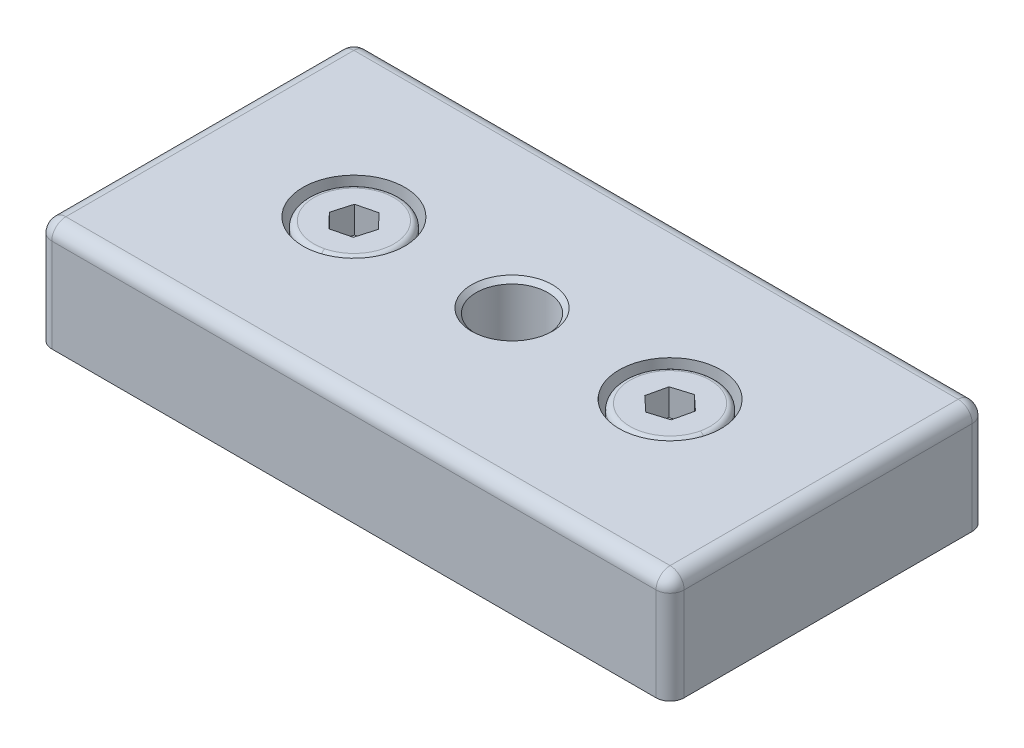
ISO-10303-21;
HEADER;
FILE_DESCRIPTION(('STEP AP214'),'2;1');
FILE_NAME('part.step','',(''),(''),'','','');
FILE_SCHEMA(('AUTOMOTIVE_DESIGN { 1 0 10303 214 1 1 1 1 }'));
ENDSEC;
DATA;
#1=APPLICATION_CONTEXT('core data for automotive mechanical design processes');
#2=APPLICATION_PROTOCOL_DEFINITION('international standard','automotive_design',2000,#1);
#3=PRODUCT_CONTEXT('',#1,'mechanical');
#4=PRODUCT('Part','Part','',(#3));
#5=PRODUCT_RELATED_PRODUCT_CATEGORY('part','',(#4));
#6=PRODUCT_DEFINITION_FORMATION('','',#4);
#7=PRODUCT_DEFINITION_CONTEXT('part definition',#1,'design');
#8=PRODUCT_DEFINITION('design','',#6,#7);
#9=PRODUCT_DEFINITION_SHAPE('','',#8);
#10=(LENGTH_UNIT() NAMED_UNIT(*) SI_UNIT(.MILLI.,.METRE.));
#11=(NAMED_UNIT(*) PLANE_ANGLE_UNIT() SI_UNIT($,.RADIAN.));
#12=(NAMED_UNIT(*) SI_UNIT($,.STERADIAN.) SOLID_ANGLE_UNIT());
#13=UNCERTAINTY_MEASURE_WITH_UNIT(LENGTH_MEASURE(1.E-05),#10,'distance_accuracy_value','');
#14=(GEOMETRIC_REPRESENTATION_CONTEXT(3) GLOBAL_UNCERTAINTY_ASSIGNED_CONTEXT((#13)) GLOBAL_UNIT_ASSIGNED_CONTEXT((#10,
#11,#12)) REPRESENTATION_CONTEXT('',''));
#15=CARTESIAN_POINT('',(0.,0.,0.));
#16=DIRECTION('',(0.,0.,1.));
#17=DIRECTION('',(1.,0.,0.));
#18=AXIS2_PLACEMENT_3D('',#15,#16,#17);
#19=CARTESIAN_POINT('',(-27.0113600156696,5.7909396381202,0.722244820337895));
#20=DIRECTION('',(0.,1.,0.));
#21=DIRECTION('',(0.23994544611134,0.,0.970786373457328));
#22=AXIS2_PLACEMENT_3D('',#19,#20,#21);
#23=CONICAL_SURFACE('',#22,2.5,1.0471975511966);
#24=DIRECTION('',(-0.20779885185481,0.5,-0.840725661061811));
#25=VECTOR('',#24,1.);
#26=CARTESIAN_POINT('',(-27.611223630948,5.7909396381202,-1.70472111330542));
#27=LINE('',#26,#25);
#28=CARTESIAN_POINT('',(-27.0113600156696,4.34756396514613,0.722244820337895));
#29=VERTEX_POINT('',#28);
#30=CARTESIAN_POINT('',(-27.611223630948,5.7909396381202,-1.70472111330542));
#31=VERTEX_POINT('',#30);
#32=EDGE_CURVE('P0_E333',#29,#31,#27,.T.);
#33=ORIENTED_EDGE('',*,*,#32,.F.);
#34=DIRECTION('',(0.20779885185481,0.5,0.840725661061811));
#35=VECTOR('',#34,1.);
#36=CARTESIAN_POINT('',(-26.4114964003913,5.7909396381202,3.14921075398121));
#37=LINE('',#36,#35);
#38=CARTESIAN_POINT('',(-26.4114964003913,5.7909396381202,3.14921075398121));
#39=VERTEX_POINT('',#38);
#40=EDGE_CURVE('P0_E336',#29,#39,#37,.T.);
#41=ORIENTED_EDGE('',*,*,#40,.T.);
#42=CARTESIAN_POINT('',(-27.0113600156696,5.7909396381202,0.722244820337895));
#43=DIRECTION('',(0.,1.,0.));
#44=DIRECTION('',(0.23994544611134,0.,0.970786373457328));
#45=AXIS2_PLACEMENT_3D('',#42,#43,#44);
#46=CIRCLE('',#45,2.5);
#47=CARTESIAN_POINT('',(-24.6096140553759,5.7909396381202,1.41623065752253));
#48=VERTEX_POINT('',#47);
#49=EDGE_CURVE('P0_E10',#39,#48,#46,.T.);
#50=ORIENTED_EDGE('',*,*,#49,.T.);
#51=CARTESIAN_POINT('',(-27.0113600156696,5.7909396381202,0.722244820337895));
#52=DIRECTION('',(0.,1.,0.));
#53=DIRECTION('',(0.23994544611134,0.,0.970786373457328));
#54=AXIS2_PLACEMENT_3D('',#51,#52,#53);
#55=CIRCLE('',#54,2.5);
#56=CARTESIAN_POINT('',(-25.2094776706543,5.7909396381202,-1.01073527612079));
#57=VERTEX_POINT('',#56);
#58=EDGE_CURVE('P0_E26',#48,#57,#55,.T.);
#59=ORIENTED_EDGE('',*,*,#58,.T.);
#60=CARTESIAN_POINT('',(-27.0113600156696,5.7909396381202,0.722244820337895));
#61=DIRECTION('',(0.,1.,0.));
#62=DIRECTION('',(0.23994544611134,0.,0.970786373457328));
#63=AXIS2_PLACEMENT_3D('',#60,#61,#62);
#64=CIRCLE('',#63,2.5);
#65=EDGE_CURVE('P0_E19',#57,#31,#64,.T.);
#66=ORIENTED_EDGE('',*,*,#65,.T.);
#67=EDGE_LOOP('',(#33,#41,#50,#59,#66));
#68=FACE_BOUND('',#67,.T.);
#69=ADVANCED_FACE('P0_F16',(#68),#23,.F.);
#70=CARTESIAN_POINT('',(-25.0102869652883,5.7909396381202,2.80287933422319));
#71=DIRECTION('',(0.,1.,0.));
#72=DIRECTION('',(0.23994544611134,0.,0.970786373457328));
#73=AXIS2_PLACEMENT_3D('',#70,#71,#72);
#74=PLANE('',#73);
#75=ORIENTED_EDGE('',*,*,#49,.F.);
#76=DIRECTION('',(0.970786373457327,0.,-0.239945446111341));
#77=VECTOR('',#76,1.);
#78=CARTESIAN_POINT('',(-27.8127058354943,5.7909396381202,3.49554217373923));
#79=LINE('',#78,#77);
#80=CARTESIAN_POINT('',(-25.0102869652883,5.7909396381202,2.80287933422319));
#81=VERTEX_POINT('',#80);
#82=EDGE_CURVE('P0_E294',#39,#81,#79,.T.);
#83=ORIENTED_EDGE('',*,*,#82,.T.);
#84=DIRECTION('',(-0.277594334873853,0.,0.960698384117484));
#85=VECTOR('',#84,1.);
#86=CARTESIAN_POINT('',(-24.2089411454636,5.7909396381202,0.0295819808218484));
#87=LINE('',#86,#85);
#88=EDGE_CURVE('P0_E275',#48,#81,#87,.T.);
#89=ORIENTED_EDGE('',*,*,#88,.F.);
#90=EDGE_LOOP('',(#75,#83,#89));
#91=FACE_BOUND('',#90,.T.);
#92=ADVANCED_FACE('P0_F598',(#91),#74,.T.);
#93=CARTESIAN_POINT('',(-25.0102869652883,5.7909396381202,2.80287933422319));
#94=DIRECTION('',(0.,1.,0.));
#95=DIRECTION('',(0.23994544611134,0.,0.970786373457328));
#96=AXIS2_PLACEMENT_3D('',#93,#94,#95);
#97=PLANE('',#96);
#98=ORIENTED_EDGE('',*,*,#58,.F.);
#99=DIRECTION('',(-0.277594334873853,0.,0.960698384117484));
#100=VECTOR('',#99,1.);
#101=CARTESIAN_POINT('',(-24.2089411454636,5.7909396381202,0.0295819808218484));
#102=LINE('',#101,#100);
#103=CARTESIAN_POINT('',(-24.2089411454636,5.7909396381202,0.0295819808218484));
#104=VERTEX_POINT('',#103);
#105=EDGE_CURVE('P0_E271',#104,#48,#102,.T.);
#106=ORIENTED_EDGE('',*,*,#105,.F.);
#107=DIRECTION('',(-0.693192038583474,0.,-0.720752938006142));
#108=VECTOR('',#107,1.);
#109=CARTESIAN_POINT('',(-24.2089411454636,5.7909396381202,0.0295819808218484));
#110=LINE('',#109,#108);
#111=EDGE_CURVE('P0_E207',#104,#57,#110,.T.);
#112=ORIENTED_EDGE('',*,*,#111,.T.);
#113=EDGE_LOOP('',(#98,#106,#112));
#114=FACE_BOUND('',#113,.T.);
#115=ADVANCED_FACE('P0_F599',(#114),#97,.T.);
#116=CARTESIAN_POINT('',(-25.0102869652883,5.7909396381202,2.80287933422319));
#117=DIRECTION('',(0.,1.,0.));
#118=DIRECTION('',(0.23994544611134,0.,0.970786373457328));
#119=AXIS2_PLACEMENT_3D('',#116,#117,#118);
#120=PLANE('',#119);
#121=ORIENTED_EDGE('',*,*,#65,.F.);
#122=DIRECTION('',(-0.693192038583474,0.,-0.720752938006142));
#123=VECTOR('',#122,1.);
#124=CARTESIAN_POINT('',(-24.2089411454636,5.7909396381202,0.0295819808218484));
#125=LINE('',#124,#123);
#126=CARTESIAN_POINT('',(-26.210014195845,5.7909396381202,-2.05105253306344));
#127=VERTEX_POINT('',#126);
#128=EDGE_CURVE('P0_E205',#57,#127,#125,.T.);
#129=ORIENTED_EDGE('',*,*,#128,.T.);
#130=DIRECTION('',(-0.970786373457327,0.,0.239945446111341));
#131=VECTOR('',#130,1.);
#132=CARTESIAN_POINT('',(-26.210014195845,5.7909396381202,-2.05105253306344));
#133=LINE('',#132,#131);
#134=EDGE_CURVE('P0_E175',#127,#31,#133,.T.);
#135=ORIENTED_EDGE('',*,*,#134,.T.);
#136=EDGE_LOOP('',(#121,#129,#135));
#137=FACE_BOUND('',#136,.T.);
#138=ADVANCED_FACE('P0_F609',(#137),#120,.T.);
#139=CARTESIAN_POINT('',(-25.0102869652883,5.7909396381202,2.80287933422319));
#140=DIRECTION('',(0.,1.,0.));
#141=DIRECTION('',(0.23994544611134,0.,0.970786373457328));
#142=AXIS2_PLACEMENT_3D('',#139,#140,#141);
#143=PLANE('',#142);
#144=CARTESIAN_POINT('',(-27.0113600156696,5.7909396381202,0.722244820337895));
#145=DIRECTION('',(0.,1.,0.));
#146=DIRECTION('',(0.23994544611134,0.,0.970786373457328));
#147=AXIS2_PLACEMENT_3D('',#144,#145,#146);
#148=CIRCLE('',#147,2.5);
#149=CARTESIAN_POINT('',(-29.4131059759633,5.7909396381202,0.0282589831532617));
#150=VERTEX_POINT('',#149);
#151=EDGE_CURVE('P0_E170',#31,#150,#148,.T.);
#152=ORIENTED_EDGE('',*,*,#151,.F.);
#153=DIRECTION('',(-0.970786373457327,0.,0.239945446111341));
#154=VECTOR('',#153,1.);
#155=CARTESIAN_POINT('',(-26.210014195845,5.7909396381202,-2.05105253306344));
#156=LINE('',#155,#154);
#157=CARTESIAN_POINT('',(-29.012433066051,5.7909396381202,-1.35838969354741));
#158=VERTEX_POINT('',#157);
#159=EDGE_CURVE('P0_E163',#31,#158,#156,.T.);
#160=ORIENTED_EDGE('',*,*,#159,.T.);
#161=DIRECTION('',(0.277594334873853,0.,-0.960698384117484));
#162=VECTOR('',#161,1.);
#163=CARTESIAN_POINT('',(-29.8137788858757,5.7909396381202,1.41490765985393));
#164=LINE('',#163,#162);
#165=EDGE_CURVE('P0_E167',#150,#158,#164,.T.);
#166=ORIENTED_EDGE('',*,*,#165,.F.);
#167=EDGE_LOOP('',(#152,#160,#166));
#168=FACE_BOUND('',#167,.T.);
#169=ADVANCED_FACE('P0_F165',(#168),#143,.T.);
#170=CARTESIAN_POINT('',(-25.0102869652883,5.7909396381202,2.80287933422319));
#171=DIRECTION('',(0.,1.,0.));
#172=DIRECTION('',(0.23994544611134,0.,0.970786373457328));
#173=AXIS2_PLACEMENT_3D('',#170,#171,#172);
#174=PLANE('',#173);
#175=CARTESIAN_POINT('',(-27.0113600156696,5.7909396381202,0.722244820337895));
#176=DIRECTION('',(0.,1.,0.));
#177=DIRECTION('',(0.23994544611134,0.,0.970786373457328));
#178=AXIS2_PLACEMENT_3D('',#175,#176,#177);
#179=CIRCLE('',#178,2.5);
#180=CARTESIAN_POINT('',(-28.813242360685,5.7909396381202,2.45522491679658));
#181=VERTEX_POINT('',#180);
#182=EDGE_CURVE('P0_E317',#150,#181,#179,.T.);
#183=ORIENTED_EDGE('',*,*,#182,.F.);
#184=DIRECTION('',(0.277594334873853,0.,-0.960698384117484));
#185=VECTOR('',#184,1.);
#186=CARTESIAN_POINT('',(-29.8137788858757,5.7909396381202,1.41490765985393));
#187=LINE('',#186,#185);
#188=CARTESIAN_POINT('',(-29.8137788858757,5.7909396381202,1.41490765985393));
#189=VERTEX_POINT('',#188);
#190=EDGE_CURVE('P0_E189',#189,#150,#187,.T.);
#191=ORIENTED_EDGE('',*,*,#190,.F.);
#192=DIRECTION('',(-0.693192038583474,0.,-0.720752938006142));
#193=VECTOR('',#192,1.);
#194=CARTESIAN_POINT('',(-27.8127058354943,5.7909396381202,3.49554217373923));
#195=LINE('',#194,#193);
#196=EDGE_CURVE('P0_E291',#181,#189,#195,.T.);
#197=ORIENTED_EDGE('',*,*,#196,.F.);
#198=EDGE_LOOP('',(#183,#191,#197));
#199=FACE_BOUND('',#198,.T.);
#200=ADVANCED_FACE('P0_F315',(#199),#174,.T.);
#201=CARTESIAN_POINT('',(-25.0102869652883,5.7909396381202,2.80287933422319));
#202=DIRECTION('',(0.,1.,0.));
#203=DIRECTION('',(0.23994544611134,0.,0.970786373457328));
#204=AXIS2_PLACEMENT_3D('',#201,#202,#203);
#205=PLANE('',#204);
#206=CARTESIAN_POINT('',(-27.0113600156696,5.7909396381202,0.722244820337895));
#207=DIRECTION('',(0.,1.,0.));
#208=DIRECTION('',(0.23994544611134,0.,0.970786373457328));
#209=AXIS2_PLACEMENT_3D('',#206,#207,#208);
#210=CIRCLE('',#209,2.5);
#211=EDGE_CURVE('P0_E344',#181,#39,#210,.T.);
#212=ORIENTED_EDGE('',*,*,#211,.F.);
#213=DIRECTION('',(-0.693192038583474,0.,-0.720752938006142));
#214=VECTOR('',#213,1.);
#215=CARTESIAN_POINT('',(-27.8127058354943,5.7909396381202,3.49554217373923));
#216=LINE('',#215,#214);
#217=CARTESIAN_POINT('',(-27.8127058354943,5.7909396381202,3.49554217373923));
#218=VERTEX_POINT('',#217);
#219=EDGE_CURVE('P0_E302',#218,#181,#216,.T.);
#220=ORIENTED_EDGE('',*,*,#219,.F.);
#221=DIRECTION('',(0.970786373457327,0.,-0.239945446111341));
#222=VECTOR('',#221,1.);
#223=CARTESIAN_POINT('',(-27.8127058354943,5.7909396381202,3.49554217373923));
#224=LINE('',#223,#222);
#225=EDGE_CURVE('P0_E297',#218,#39,#224,.T.);
#226=ORIENTED_EDGE('',*,*,#225,.T.);
#227=EDGE_LOOP('',(#212,#220,#226));
#228=FACE_BOUND('',#227,.T.);
#229=ADVANCED_FACE('P0_F590',(#228),#205,.T.);
#230=CARTESIAN_POINT('',(-24.2089411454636,5.7909396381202,0.0295819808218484));
#231=DIRECTION('',(0.720752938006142,0.,-0.693192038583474));
#232=DIRECTION('',(0.,1.,0.));
#233=AXIS2_PLACEMENT_3D('',#230,#231,#232);
#234=PLANE('',#233);
#235=DIRECTION('',(-0.693192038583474,0.,-0.720752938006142));
#236=VECTOR('',#235,1.);
#237=CARTESIAN_POINT('',(-24.2089411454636,9.5909396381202,0.0295819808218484));
#238=LINE('',#237,#236);
#239=CARTESIAN_POINT('',(-24.2089411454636,9.5909396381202,0.0295819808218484));
#240=VERTEX_POINT('',#239);
#241=CARTESIAN_POINT('',(-26.210014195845,9.5909396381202,-2.05105253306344));
#242=VERTEX_POINT('',#241);
#243=EDGE_CURVE('P0_E260',#240,#242,#238,.T.);
#244=ORIENTED_EDGE('',*,*,#243,.T.);
#245=DIRECTION('',(0.,1.,0.));
#246=VECTOR('',#245,1.);
#247=CARTESIAN_POINT('',(-26.210014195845,5.7909396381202,-2.05105253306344));
#248=LINE('',#247,#246);
#249=EDGE_CURVE('P0_E203',#127,#242,#248,.T.);
#250=ORIENTED_EDGE('',*,*,#249,.F.);
#251=ORIENTED_EDGE('',*,*,#128,.F.);
#252=ORIENTED_EDGE('',*,*,#111,.F.);
#253=DIRECTION('',(0.,1.,0.));
#254=VECTOR('',#253,1.);
#255=CARTESIAN_POINT('',(-24.2089411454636,5.7909396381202,0.0295819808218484));
#256=LINE('',#255,#254);
#257=EDGE_CURVE('P0_E276',#104,#240,#256,.T.);
#258=ORIENTED_EDGE('',*,*,#257,.T.);
#259=EDGE_LOOP('',(#244,#250,#251,#252,#258));
#260=FACE_BOUND('',#259,.T.);
#261=ADVANCED_FACE('P0_F606',(#260),#234,.F.);
#262=CARTESIAN_POINT('',(-26.210014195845,5.7909396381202,-2.05105253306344));
#263=DIRECTION('',(-0.239945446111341,0.,-0.970786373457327));
#264=DIRECTION('',(-0.970786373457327,0.,0.239945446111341));
#265=AXIS2_PLACEMENT_3D('',#262,#263,#264);
#266=PLANE('',#265);
#267=DIRECTION('',(-0.970786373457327,0.,0.239945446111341));
#268=VECTOR('',#267,1.);
#269=CARTESIAN_POINT('',(-26.210014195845,9.5909396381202,-2.05105253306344));
#270=LINE('',#269,#268);
#271=CARTESIAN_POINT('',(-29.012433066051,9.5909396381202,-1.35838969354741));
#272=VERTEX_POINT('',#271);
#273=EDGE_CURVE('P0_E181',#242,#272,#270,.T.);
#274=ORIENTED_EDGE('',*,*,#273,.T.);
#275=DIRECTION('',(0.,1.,0.));
#276=VECTOR('',#275,1.);
#277=CARTESIAN_POINT('',(-29.012433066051,5.7909396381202,-1.35838969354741));
#278=LINE('',#277,#276);
#279=EDGE_CURVE('P0_E176',#158,#272,#278,.T.);
#280=ORIENTED_EDGE('',*,*,#279,.F.);
#281=ORIENTED_EDGE('',*,*,#159,.F.);
#282=ORIENTED_EDGE('',*,*,#134,.F.);
#283=ORIENTED_EDGE('',*,*,#249,.T.);
#284=EDGE_LOOP('',(#274,#280,#281,#282,#283));
#285=FACE_BOUND('',#284,.T.);
#286=ADVANCED_FACE('P0_F179',(#285),#266,.F.);
#287=CARTESIAN_POINT('',(-29.8137788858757,5.7909396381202,1.41490765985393));
#288=DIRECTION('',(0.960698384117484,0.,0.277594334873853));
#289=DIRECTION('',(0.,-1.,0.));
#290=AXIS2_PLACEMENT_3D('',#287,#288,#289);
#291=PLANE('',#290);
#292=DIRECTION('',(0.277594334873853,0.,-0.960698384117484));
#293=VECTOR('',#292,1.);
#294=CARTESIAN_POINT('',(-29.8137788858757,9.5909396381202,1.41490765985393));
#295=LINE('',#294,#293);
#296=CARTESIAN_POINT('',(-29.8137788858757,9.5909396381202,1.41490765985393));
#297=VERTEX_POINT('',#296);
#298=EDGE_CURVE('P0_E254',#297,#272,#295,.T.);
#299=ORIENTED_EDGE('',*,*,#298,.F.);
#300=DIRECTION('',(0.,1.,0.));
#301=VECTOR('',#300,1.);
#302=CARTESIAN_POINT('',(-29.8137788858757,5.7909396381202,1.41490765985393));
#303=LINE('',#302,#301);
#304=EDGE_CURVE('P0_E197',#189,#297,#303,.T.);
#305=ORIENTED_EDGE('',*,*,#304,.F.);
#306=ORIENTED_EDGE('',*,*,#190,.T.);
#307=ORIENTED_EDGE('',*,*,#165,.T.);
#308=ORIENTED_EDGE('',*,*,#279,.T.);
#309=EDGE_LOOP('',(#299,#305,#306,#307,#308));
#310=FACE_BOUND('',#309,.T.);
#311=ADVANCED_FACE('P0_F187',(#310),#291,.T.);
#312=CARTESIAN_POINT('',(-27.8127058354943,5.7909396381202,3.49554217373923));
#313=DIRECTION('',(0.720752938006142,0.,-0.693192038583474));
#314=DIRECTION('',(0.,1.,0.));
#315=AXIS2_PLACEMENT_3D('',#312,#313,#314);
#316=PLANE('',#315);
#317=DIRECTION('',(-0.693192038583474,0.,-0.720752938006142));
#318=VECTOR('',#317,1.);
#319=CARTESIAN_POINT('',(-27.8127058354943,9.5909396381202,3.49554217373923));
#320=LINE('',#319,#318);
#321=CARTESIAN_POINT('',(-27.8127058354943,9.5909396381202,3.49554217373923));
#322=VERTEX_POINT('',#321);
#323=EDGE_CURVE('P0_E257',#322,#297,#320,.T.);
#324=ORIENTED_EDGE('',*,*,#323,.F.);
#325=DIRECTION('',(0.,1.,0.));
#326=VECTOR('',#325,1.);
#327=CARTESIAN_POINT('',(-27.8127058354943,5.7909396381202,3.49554217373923));
#328=LINE('',#327,#326);
#329=EDGE_CURVE('P0_E301',#218,#322,#328,.T.);
#330=ORIENTED_EDGE('',*,*,#329,.F.);
#331=ORIENTED_EDGE('',*,*,#219,.T.);
#332=ORIENTED_EDGE('',*,*,#196,.T.);
#333=ORIENTED_EDGE('',*,*,#304,.T.);
#334=EDGE_LOOP('',(#324,#330,#331,#332,#333));
#335=FACE_BOUND('',#334,.T.);
#336=ADVANCED_FACE('P0_F311',(#335),#316,.T.);
#337=CARTESIAN_POINT('',(-27.8127058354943,5.7909396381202,3.49554217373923));
#338=DIRECTION('',(0.239945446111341,0.,0.970786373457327));
#339=DIRECTION('',(-0.970786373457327,0.,0.239945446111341));
#340=AXIS2_PLACEMENT_3D('',#337,#338,#339);
#341=PLANE('',#340);
#342=DIRECTION('',(0.970786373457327,0.,-0.239945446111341));
#343=VECTOR('',#342,1.);
#344=CARTESIAN_POINT('',(-27.8127058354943,9.5909396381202,3.49554217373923));
#345=LINE('',#344,#343);
#346=CARTESIAN_POINT('',(-25.0102869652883,9.5909396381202,2.80287933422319));
#347=VERTEX_POINT('',#346);
#348=EDGE_CURVE('P0_E251',#322,#347,#345,.T.);
#349=ORIENTED_EDGE('',*,*,#348,.T.);
#350=DIRECTION('',(0.,1.,0.));
#351=VECTOR('',#350,1.);
#352=CARTESIAN_POINT('',(-25.0102869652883,5.7909396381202,2.80287933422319));
#353=LINE('',#352,#351);
#354=EDGE_CURVE('P0_E288',#81,#347,#353,.T.);
#355=ORIENTED_EDGE('',*,*,#354,.F.);
#356=ORIENTED_EDGE('',*,*,#82,.F.);
#357=ORIENTED_EDGE('',*,*,#225,.F.);
#358=ORIENTED_EDGE('',*,*,#329,.T.);
#359=EDGE_LOOP('',(#349,#355,#356,#357,#358));
#360=FACE_BOUND('',#359,.T.);
#361=ADVANCED_FACE('P0_F595',(#360),#341,.F.);
#362=CARTESIAN_POINT('',(-24.2089411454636,5.7909396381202,0.0295819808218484));
#363=DIRECTION('',(-0.960698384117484,0.,-0.277594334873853));
#364=DIRECTION('',(0.277594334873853,0.,-0.960698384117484));
#365=AXIS2_PLACEMENT_3D('',#362,#363,#364);
#366=PLANE('',#365);
#367=DIRECTION('',(-0.277594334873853,0.,0.960698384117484));
#368=VECTOR('',#367,1.);
#369=CARTESIAN_POINT('',(-24.2089411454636,9.5909396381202,0.0295819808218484));
#370=LINE('',#369,#368);
#371=EDGE_CURVE('P0_E247',#240,#347,#370,.T.);
#372=ORIENTED_EDGE('',*,*,#371,.F.);
#373=ORIENTED_EDGE('',*,*,#257,.F.);
#374=ORIENTED_EDGE('',*,*,#105,.T.);
#375=ORIENTED_EDGE('',*,*,#88,.T.);
#376=ORIENTED_EDGE('',*,*,#354,.T.);
#377=EDGE_LOOP('',(#372,#373,#374,#375,#376));
#378=FACE_BOUND('',#377,.T.);
#379=ADVANCED_FACE('P0_F603',(#378),#366,.T.);
#380=CARTESIAN_POINT('',(-27.0113600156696,8.7909396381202,0.722244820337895));
#381=DIRECTION('',(0.,1.,0.));
#382=DIRECTION('',(0.23994544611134,0.,0.970786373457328));
#383=AXIS2_PLACEMENT_3D('',#380,#381,#382);
#384=TOROIDAL_SURFACE('',#383,5.7,0.8);
#385=CARTESIAN_POINT('',(-28.3790490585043,8.7909396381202,-4.81123750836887));
#386=DIRECTION('',(0.970786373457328,0.,-0.23994544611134));
#387=DIRECTION('',(0.23994544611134,0.,0.970786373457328));
#388=AXIS2_PLACEMENT_3D('',#385,#386,#387);
#389=CIRCLE('',#388,0.8);
#390=CARTESIAN_POINT('',(-28.5710054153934,8.7909396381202,-5.58786660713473));
#391=VERTEX_POINT('',#390);
#392=CARTESIAN_POINT('',(-28.3790490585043,9.5909396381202,-4.81123750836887));
#393=VERTEX_POINT('',#392);
#394=EDGE_CURVE('P0_E343',#391,#393,#389,.T.);
#395=ORIENTED_EDGE('',*,*,#394,.F.);
#396=CARTESIAN_POINT('',(-27.0113600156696,8.7909396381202,0.722244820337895));
#397=DIRECTION('',(0.,-1.,0.));
#398=DIRECTION('',(0.23994544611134,0.,0.970786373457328));
#399=AXIS2_PLACEMENT_3D('',#396,#397,#398);
#400=CIRCLE('',#399,6.5);
#401=CARTESIAN_POINT('',(-25.4517146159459,8.7909396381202,7.03235624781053));
#402=VERTEX_POINT('',#401);
#403=EDGE_CURVE('P0_E267',#402,#391,#400,.T.);
#404=ORIENTED_EDGE('',*,*,#403,.F.);
#405=CARTESIAN_POINT('',(-25.643670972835,8.7909396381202,6.25572714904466));
#406=DIRECTION('',(-0.970786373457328,0.,0.23994544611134));
#407=DIRECTION('',(-0.23994544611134,0.,-0.970786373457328));
#408=AXIS2_PLACEMENT_3D('',#405,#406,#407);
#409=CIRCLE('',#408,0.8);
#410=CARTESIAN_POINT('',(-25.643670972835,9.5909396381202,6.25572714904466));
#411=VERTEX_POINT('',#410);
#412=EDGE_CURVE('P0_E362',#402,#411,#409,.T.);
#413=ORIENTED_EDGE('',*,*,#412,.T.);
#414=CARTESIAN_POINT('',(-27.0113600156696,9.5909396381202,0.722244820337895));
#415=DIRECTION('',(0.,1.,0.));
#416=DIRECTION('',(0.23994544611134,0.,0.970786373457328));
#417=AXIS2_PLACEMENT_3D('',#414,#415,#416);
#418=CIRCLE('',#417,5.7);
#419=EDGE_CURVE('P0_E244',#393,#411,#418,.T.);
#420=ORIENTED_EDGE('',*,*,#419,.F.);
#421=EDGE_LOOP('',(#395,#404,#413,#420));
#422=FACE_BOUND('',#421,.T.);
#423=ADVANCED_FACE('P0_F640',(#422),#384,.T.);
#424=CARTESIAN_POINT('',(-27.0113600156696,4.1909396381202,0.722244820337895));
#425=DIRECTION('',(0.,-1.,0.));
#426=DIRECTION('',(-0.23994544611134,0.,-0.970786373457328));
#427=AXIS2_PLACEMENT_3D('',#424,#425,#426);
#428=TOROIDAL_SURFACE('',#427,4.39999999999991,0.4);
#429=CARTESIAN_POINT('',(-25.9556000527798,4.1909396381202,4.99370486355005));
#430=DIRECTION('',(0.970786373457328,0.,-0.23994544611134));
#431=DIRECTION('',(0.23994544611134,0.,0.970786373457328));
#432=AXIS2_PLACEMENT_3D('',#429,#430,#431);
#433=CIRCLE('',#432,0.4);
#434=CARTESIAN_POINT('',(-26.0515782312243,4.1909396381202,4.60539031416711));
#435=VERTEX_POINT('',#434);
#436=CARTESIAN_POINT('',(-25.9556000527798,4.5909396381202,4.99370486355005));
#437=VERTEX_POINT('',#436);
#438=EDGE_CURVE('P0_E372',#435,#437,#433,.T.);
#439=ORIENTED_EDGE('',*,*,#438,.F.);
#440=CARTESIAN_POINT('',(-27.0113600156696,4.1909396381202,0.722244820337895));
#441=DIRECTION('',(0.,-1.,0.));
#442=DIRECTION('',(-0.23994544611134,0.,-0.970786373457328));
#443=AXIS2_PLACEMENT_3D('',#440,#441,#442);
#444=CIRCLE('',#443,3.99999999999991);
#445=CARTESIAN_POINT('',(-27.971141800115,4.1909396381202,-3.16090067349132));
#446=VERTEX_POINT('',#445);
#447=EDGE_CURVE('P0_E227',#446,#435,#444,.T.);
#448=ORIENTED_EDGE('',*,*,#447,.F.);
#449=CARTESIAN_POINT('',(-28.0671199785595,4.1909396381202,-3.54921522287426));
#450=DIRECTION('',(-0.970786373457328,0.,0.23994544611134));
#451=DIRECTION('',(-0.23994544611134,0.,-0.970786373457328));
#452=AXIS2_PLACEMENT_3D('',#449,#450,#451);
#453=CIRCLE('',#452,0.4);
#454=CARTESIAN_POINT('',(-28.0671199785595,4.5909396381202,-3.54921522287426));
#455=VERTEX_POINT('',#454);
#456=EDGE_CURVE('P0_E354',#446,#455,#453,.T.);
#457=ORIENTED_EDGE('',*,*,#456,.T.);
#458=CARTESIAN_POINT('',(-27.0113600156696,4.5909396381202,0.722244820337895));
#459=DIRECTION('',(0.,1.,0.));
#460=DIRECTION('',(-0.23994544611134,0.,-0.970786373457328));
#461=AXIS2_PLACEMENT_3D('',#458,#459,#460);
#462=CIRCLE('',#461,4.39999999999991);
#463=EDGE_CURVE('P0_E270',#437,#455,#462,.T.);
#464=ORIENTED_EDGE('',*,*,#463,.F.);
#465=EDGE_LOOP('',(#439,#448,#457,#464));
#466=FACE_BOUND('',#465,.T.);
#467=ADVANCED_FACE('P0_F643',(#466),#428,.F.);
#468=CARTESIAN_POINT('',(-23.7985425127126,-20.4090603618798,-0.0718546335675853));
#469=DIRECTION('',(0.,-1.,0.));
#470=DIRECTION('',(0.970786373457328,0.,-0.23994544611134));
#471=AXIS2_PLACEMENT_3D('',#468,#469,#470);
#472=PLANE('',#471);
#473=CARTESIAN_POINT('',(-27.0113600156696,-20.4090603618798,0.722244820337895));
#474=DIRECTION('',(0.,1.,0.));
#475=DIRECTION('',(0.23994544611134,0.,0.970786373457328));
#476=AXIS2_PLACEMENT_3D('',#473,#474,#475);
#477=CIRCLE('',#476,3.3095);
#478=CARTESIAN_POINT('',(-26.2172605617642,-20.4090603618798,3.93506232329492));
#479=VERTEX_POINT('',#478);
#480=CARTESIAN_POINT('',(-27.8054594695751,-20.4090603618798,-2.49057268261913));
#481=VERTEX_POINT('',#480);
#482=EDGE_CURVE('P0_E350',#479,#481,#477,.T.);
#483=ORIENTED_EDGE('',*,*,#482,.F.);
#484=CARTESIAN_POINT('',(-27.0113600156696,-20.4090603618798,0.722244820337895));
#485=DIRECTION('',(0.,1.,0.));
#486=DIRECTION('',(0.23994544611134,0.,0.970786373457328));
#487=AXIS2_PLACEMENT_3D('',#484,#485,#486);
#488=CIRCLE('',#487,3.3095);
#489=EDGE_CURVE('P0_E280',#481,#479,#488,.T.);
#490=ORIENTED_EDGE('',*,*,#489,.F.);
#491=EDGE_LOOP('',(#483,#490));
#492=FACE_BOUND('',#491,.T.);
#493=ADVANCED_FACE('P0_F649',(#492),#472,.T.);
#494=CARTESIAN_POINT('',(-27.0113600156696,-20.4090603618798,0.722244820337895));
#495=DIRECTION('',(0.,1.,0.));
#496=DIRECTION('',(0.23994544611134,0.,0.970786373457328));
#497=AXIS2_PLACEMENT_3D('',#494,#495,#496);
#498=CONICAL_SURFACE('',#497,3.3095,0.785398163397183);
#499=DIRECTION('',(-0.169667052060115,0.707106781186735,-0.686449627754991));
#500=VECTOR('',#499,1.);
#501=CARTESIAN_POINT('',(-27.8054594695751,-20.4090603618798,-2.49057268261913));
#502=LINE('',#501,#500);
#503=CARTESIAN_POINT('',(-27.971141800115,-19.7185603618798,-3.16090067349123));
#504=VERTEX_POINT('',#503);
#505=EDGE_CURVE('P0_E345',#481,#504,#502,.T.);
#506=ORIENTED_EDGE('',*,*,#505,.F.);
#507=ORIENTED_EDGE('',*,*,#489,.T.);
#508=DIRECTION('',(0.169667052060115,0.707106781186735,0.686449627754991));
#509=VECTOR('',#508,1.);
#510=CARTESIAN_POINT('',(-26.2172605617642,-20.4090603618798,3.93506232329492));
#511=LINE('',#510,#509);
#512=CARTESIAN_POINT('',(-26.0515782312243,-19.7185603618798,4.60539031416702));
#513=VERTEX_POINT('',#512);
#514=EDGE_CURVE('P0_E384',#479,#513,#511,.T.);
#515=ORIENTED_EDGE('',*,*,#514,.T.);
#516=CARTESIAN_POINT('',(-27.0113600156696,-19.7185603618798,0.722244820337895));
#517=DIRECTION('',(0.,1.,0.));
#518=DIRECTION('',(0.23994544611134,0.,0.970786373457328));
#519=AXIS2_PLACEMENT_3D('',#516,#517,#518);
#520=CIRCLE('',#519,3.99999999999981);
#521=EDGE_CURVE('P0_E277',#504,#513,#520,.T.);
#522=ORIENTED_EDGE('',*,*,#521,.F.);
#523=EDGE_LOOP('',(#506,#507,#515,#522));
#524=FACE_BOUND('',#523,.T.);
#525=ADVANCED_FACE('P0_F653',(#524),#498,.T.);
#526=CARTESIAN_POINT('',(-27.0113600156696,41.3409396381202,0.722244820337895));
#527=DIRECTION('',(0.,1.,0.));
#528=DIRECTION('',(0.23994544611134,0.,0.970786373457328));
#529=AXIS2_PLACEMENT_3D('',#526,#527,#528);
#530=CYLINDRICAL_SURFACE('',#529,3.99999999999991);
#531=DIRECTION('',(0.,1.,0.));
#532=VECTOR('',#531,1.);
#533=CARTESIAN_POINT('',(-27.971141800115,41.3409396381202,-3.16090067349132));
#534=LINE('',#533,#532);
#535=EDGE_CURVE('P0_E225',#504,#446,#534,.T.);
#536=ORIENTED_EDGE('',*,*,#535,.F.);
#537=ORIENTED_EDGE('',*,*,#521,.T.);
#538=DIRECTION('',(0.,1.,0.));
#539=VECTOR('',#538,1.);
#540=CARTESIAN_POINT('',(-26.0515782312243,41.3409396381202,4.60539031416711));
#541=LINE('',#540,#539);
#542=EDGE_CURVE('P0_E231',#513,#435,#541,.T.);
#543=ORIENTED_EDGE('',*,*,#542,.T.);
#544=CARTESIAN_POINT('',(-27.0113600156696,4.1909396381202,0.722244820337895));
#545=DIRECTION('',(0.,-1.,0.));
#546=DIRECTION('',(-0.23994544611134,0.,-0.970786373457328));
#547=AXIS2_PLACEMENT_3D('',#544,#545,#546);
#548=CIRCLE('',#547,3.99999999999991);
#549=EDGE_CURVE('P0_E366',#435,#446,#548,.T.);
#550=ORIENTED_EDGE('',*,*,#549,.T.);
#551=EDGE_LOOP('',(#536,#537,#543,#550));
#552=FACE_BOUND('',#551,.T.);
#553=ADVANCED_FACE('P0_F414',(#552),#530,.T.);
#554=CARTESIAN_POINT('',(-20.701248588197,4.5909396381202,-0.837400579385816));
#555=DIRECTION('',(0.,-1.,0.));
#556=DIRECTION('',(0.970786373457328,0.,-0.23994544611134));
#557=AXIS2_PLACEMENT_3D('',#554,#555,#556);
#558=PLANE('',#557);
#559=CARTESIAN_POINT('',(-27.0113600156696,4.5909396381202,0.722244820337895));
#560=DIRECTION('',(0.,1.,0.));
#561=DIRECTION('',(-0.23994544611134,0.,-0.970786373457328));
#562=AXIS2_PLACEMENT_3D('',#559,#560,#561);
#563=CIRCLE('',#562,4.39999999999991);
#564=EDGE_CURVE('P0_E376',#455,#437,#563,.T.);
#565=ORIENTED_EDGE('',*,*,#564,.T.);
#566=ORIENTED_EDGE('',*,*,#463,.T.);
#567=EDGE_LOOP('',(#565,#566));
#568=FACE_BOUND('',#567,.T.);
#569=CARTESIAN_POINT('',(-27.0113600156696,4.5909396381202,0.722244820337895));
#570=DIRECTION('',(0.,1.,0.));
#571=DIRECTION('',(0.23994544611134,0.,0.970786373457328));
#572=AXIS2_PLACEMENT_3D('',#569,#570,#571);
#573=CIRCLE('',#572,6.5);
#574=CARTESIAN_POINT('',(-25.4517146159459,4.5909396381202,7.03235624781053));
#575=VERTEX_POINT('',#574);
#576=CARTESIAN_POINT('',(-28.5710054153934,4.5909396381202,-5.58786660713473));
#577=VERTEX_POINT('',#576);
#578=EDGE_CURVE('P0_E235',#575,#577,#573,.T.);
#579=ORIENTED_EDGE('',*,*,#578,.F.);
#580=CARTESIAN_POINT('',(-27.0113600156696,4.5909396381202,0.722244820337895));
#581=DIRECTION('',(0.,1.,0.));
#582=DIRECTION('',(0.23994544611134,0.,0.970786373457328));
#583=AXIS2_PLACEMENT_3D('',#580,#581,#582);
#584=CIRCLE('',#583,6.5);
#585=EDGE_CURVE('P0_E264',#577,#575,#584,.T.);
#586=ORIENTED_EDGE('',*,*,#585,.F.);
#587=EDGE_LOOP('',(#579,#586));
#588=FACE_BOUND('',#587,.T.);
#589=ADVANCED_FACE('P0_F659',(#568,#588),#558,.T.);
#590=CARTESIAN_POINT('',(-27.0113600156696,41.3409396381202,0.722244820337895));
#591=DIRECTION('',(0.,1.,0.));
#592=DIRECTION('',(0.23994544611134,0.,0.970786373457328));
#593=AXIS2_PLACEMENT_3D('',#590,#591,#592);
#594=CYLINDRICAL_SURFACE('',#593,6.5);
#595=DIRECTION('',(0.,1.,0.));
#596=VECTOR('',#595,1.);
#597=CARTESIAN_POINT('',(-28.5710054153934,41.3409396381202,-5.58786660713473));
#598=LINE('',#597,#596);
#599=EDGE_CURVE('P0_E236',#577,#391,#598,.T.);
#600=ORIENTED_EDGE('',*,*,#599,.F.);
#601=ORIENTED_EDGE('',*,*,#585,.T.);
#602=DIRECTION('',(0.,1.,0.));
#603=VECTOR('',#602,1.);
#604=CARTESIAN_POINT('',(-25.4517146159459,41.3409396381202,7.03235624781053));
#605=LINE('',#604,#603);
#606=EDGE_CURVE('P0_E240',#575,#402,#605,.T.);
#607=ORIENTED_EDGE('',*,*,#606,.T.);
#608=ORIENTED_EDGE('',*,*,#403,.T.);
#609=EDGE_LOOP('',(#600,#601,#607,#608));
#610=FACE_BOUND('',#609,.T.);
#611=ADVANCED_FACE('P0_F662',(#610),#594,.T.);
#612=CARTESIAN_POINT('',(-27.0113600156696,9.5909396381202,0.722244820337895));
#613=DIRECTION('',(0.,1.,0.));
#614=DIRECTION('',(0.23994544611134,0.,0.970786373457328));
#615=AXIS2_PLACEMENT_3D('',#612,#613,#614);
#616=PLANE('',#615);
#617=ORIENTED_EDGE('',*,*,#371,.T.);
#618=ORIENTED_EDGE('',*,*,#348,.F.);
#619=ORIENTED_EDGE('',*,*,#323,.T.);
#620=ORIENTED_EDGE('',*,*,#298,.T.);
#621=ORIENTED_EDGE('',*,*,#273,.F.);
#622=ORIENTED_EDGE('',*,*,#243,.F.);
#623=EDGE_LOOP('',(#617,#618,#619,#620,#621,#622));
#624=FACE_BOUND('',#623,.T.);
#625=CARTESIAN_POINT('',(-27.0113600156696,9.5909396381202,0.722244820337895));
#626=DIRECTION('',(0.,1.,0.));
#627=DIRECTION('',(0.23994544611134,0.,0.970786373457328));
#628=AXIS2_PLACEMENT_3D('',#625,#626,#627);
#629=CIRCLE('',#628,5.7);
#630=EDGE_CURVE('P0_E358',#411,#393,#629,.T.);
#631=ORIENTED_EDGE('',*,*,#630,.T.);
#632=ORIENTED_EDGE('',*,*,#419,.T.);
#633=EDGE_LOOP('',(#631,#632));
#634=FACE_BOUND('',#633,.T.);
#635=ADVANCED_FACE('P0_F321',(#624,#634),#616,.T.);
#636=CARTESIAN_POINT('',(-27.0113600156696,41.3409396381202,0.722244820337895));
#637=DIRECTION('',(0.,1.,0.));
#638=DIRECTION('',(0.23994544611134,0.,0.970786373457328));
#639=AXIS2_PLACEMENT_3D('',#636,#637,#638);
#640=CYLINDRICAL_SURFACE('',#639,6.5);
#641=ORIENTED_EDGE('',*,*,#578,.T.);
#642=ORIENTED_EDGE('',*,*,#599,.T.);
#643=CARTESIAN_POINT('',(-27.0113600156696,8.7909396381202,0.722244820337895));
#644=DIRECTION('',(0.,-1.,0.));
#645=DIRECTION('',(0.23994544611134,0.,0.970786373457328));
#646=AXIS2_PLACEMENT_3D('',#643,#644,#645);
#647=CIRCLE('',#646,6.5);
#648=EDGE_CURVE('P0_E339',#391,#402,#647,.T.);
#649=ORIENTED_EDGE('',*,*,#648,.T.);
#650=ORIENTED_EDGE('',*,*,#606,.F.);
#651=EDGE_LOOP('',(#641,#642,#649,#650));
#652=FACE_BOUND('',#651,.T.);
#653=ADVANCED_FACE('P0_F669',(#652),#640,.T.);
#654=CARTESIAN_POINT('',(-27.0113600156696,41.3409396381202,0.722244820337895));
#655=DIRECTION('',(0.,1.,0.));
#656=DIRECTION('',(0.23994544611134,0.,0.970786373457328));
#657=AXIS2_PLACEMENT_3D('',#654,#655,#656);
#658=CYLINDRICAL_SURFACE('',#657,3.99999999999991);
#659=CARTESIAN_POINT('',(-27.0113600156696,-19.7185603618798,0.722244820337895));
#660=DIRECTION('',(0.,1.,0.));
#661=DIRECTION('',(0.23994544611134,0.,0.970786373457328));
#662=AXIS2_PLACEMENT_3D('',#659,#660,#661);
#663=CIRCLE('',#662,3.99999999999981);
#664=EDGE_CURVE('P0_E349',#513,#504,#663,.T.);
#665=ORIENTED_EDGE('',*,*,#664,.T.);
#666=ORIENTED_EDGE('',*,*,#535,.T.);
#667=ORIENTED_EDGE('',*,*,#447,.T.);
#668=ORIENTED_EDGE('',*,*,#542,.F.);
#669=EDGE_LOOP('',(#665,#666,#667,#668));
#670=FACE_BOUND('',#669,.T.);
#671=ADVANCED_FACE('P0_F673',(#670),#658,.T.);
#672=CARTESIAN_POINT('',(-27.0113600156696,-20.4090603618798,0.722244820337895));
#673=DIRECTION('',(0.,1.,0.));
#674=DIRECTION('',(0.23994544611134,0.,0.970786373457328));
#675=AXIS2_PLACEMENT_3D('',#672,#673,#674);
#676=CONICAL_SURFACE('',#675,3.3095,0.785398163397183);
#677=ORIENTED_EDGE('',*,*,#482,.T.);
#678=ORIENTED_EDGE('',*,*,#505,.T.);
#679=ORIENTED_EDGE('',*,*,#664,.F.);
#680=ORIENTED_EDGE('',*,*,#514,.F.);
#681=EDGE_LOOP('',(#677,#678,#679,#680));
#682=FACE_BOUND('',#681,.T.);
#683=ADVANCED_FACE('P0_F670',(#682),#676,.T.);
#684=CARTESIAN_POINT('',(-27.0113600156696,4.1909396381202,0.722244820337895));
#685=DIRECTION('',(0.,-1.,0.));
#686=DIRECTION('',(-0.23994544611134,0.,-0.970786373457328));
#687=AXIS2_PLACEMENT_3D('',#684,#685,#686);
#688=TOROIDAL_SURFACE('',#687,4.39999999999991,0.4);
#689=ORIENTED_EDGE('',*,*,#549,.F.);
#690=ORIENTED_EDGE('',*,*,#438,.T.);
#691=ORIENTED_EDGE('',*,*,#564,.F.);
#692=ORIENTED_EDGE('',*,*,#456,.F.);
#693=EDGE_LOOP('',(#689,#690,#691,#692));
#694=FACE_BOUND('',#693,.T.);
#695=ADVANCED_FACE('P0_F417',(#694),#688,.F.);
#696=CARTESIAN_POINT('',(-27.0113600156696,8.7909396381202,0.722244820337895));
#697=DIRECTION('',(0.,1.,0.));
#698=DIRECTION('',(0.23994544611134,0.,0.970786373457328));
#699=AXIS2_PLACEMENT_3D('',#696,#697,#698);
#700=TOROIDAL_SURFACE('',#699,5.7,0.8);
#701=ORIENTED_EDGE('',*,*,#648,.F.);
#702=ORIENTED_EDGE('',*,*,#394,.T.);
#703=ORIENTED_EDGE('',*,*,#630,.F.);
#704=ORIENTED_EDGE('',*,*,#412,.F.);
#705=EDGE_LOOP('',(#701,#702,#703,#704));
#706=FACE_BOUND('',#705,.T.);
#707=ADVANCED_FACE('P0_F680',(#706),#700,.T.);
#708=CARTESIAN_POINT('',(-27.0113600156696,5.7909396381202,0.722244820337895));
#709=DIRECTION('',(0.,1.,0.));
#710=DIRECTION('',(0.23994544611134,0.,0.970786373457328));
#711=AXIS2_PLACEMENT_3D('',#708,#709,#710);
#712=CONICAL_SURFACE('',#711,2.5,1.0471975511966);
#713=ORIENTED_EDGE('',*,*,#40,.F.);
#714=ORIENTED_EDGE('',*,*,#32,.T.);
#715=ORIENTED_EDGE('',*,*,#151,.T.);
#716=ORIENTED_EDGE('',*,*,#182,.T.);
#717=ORIENTED_EDGE('',*,*,#211,.T.);
#718=EDGE_LOOP('',(#713,#714,#715,#716,#717));
#719=FACE_BOUND('',#718,.T.);
#720=ADVANCED_FACE('P0_F588',(#719),#712,.F.);
#721=CLOSED_SHELL('',(#69,#92,#115,#138,#169,#200,#229,#261,#286,#311,#336,#361,#379,#423,#467,
#493,#525,#553,#589,#611,#635,#653,#671,#683,#695,#707,#720));
#722=MANIFOLD_SOLID_BREP('P0_B1',#721);
#723=CARTESIAN_POINT('',(17.9886399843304,5.7909396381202,0.722244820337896));
#724=DIRECTION('',(0.,1.,0.));
#725=DIRECTION('',(-0.974804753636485,0.,-0.223059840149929));
#726=AXIS2_PLACEMENT_3D('',#723,#724,#725);
#727=CONICAL_SURFACE('',#726,2.5,1.0471975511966);
#728=DIRECTION('',(0.844205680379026,0.5,0.193175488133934));
#729=VECTOR('',#728,1.);
#730=CARTESIAN_POINT('',(20.4256518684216,5.7909396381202,1.27989442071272));
#731=LINE('',#730,#729);
#732=CARTESIAN_POINT('',(17.9886399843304,4.34756396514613,0.722244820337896));
#733=VERTEX_POINT('',#732);
#734=CARTESIAN_POINT('',(20.4256518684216,5.7909396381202,1.27989442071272));
#735=VERTEX_POINT('',#734);
#736=EDGE_CURVE('P1_E334',#733,#735,#731,.T.);
#737=ORIENTED_EDGE('',*,*,#736,.F.);
#738=DIRECTION('',(-0.844205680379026,0.5,-0.193175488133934));
#739=VECTOR('',#738,1.);
#740=CARTESIAN_POINT('',(15.5516281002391,5.7909396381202,0.164595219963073));
#741=LINE('',#740,#739);
#742=CARTESIAN_POINT('',(15.5516281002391,5.7909396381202,0.164595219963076));
#743=VERTEX_POINT('',#742);
#744=EDGE_CURVE('P1_E337',#733,#743,#741,.T.);
#745=ORIENTED_EDGE('',*,*,#744,.T.);
#746=CARTESIAN_POINT('',(17.9886399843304,5.7909396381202,0.722244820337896));
#747=DIRECTION('',(0.,1.,0.));
#748=DIRECTION('',(-0.974804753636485,0.,-0.223059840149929));
#749=AXIS2_PLACEMENT_3D('',#746,#747,#748);
#750=CIRCLE('',#749,2.5);
#751=CARTESIAN_POINT('',(16.2871953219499,5.7909396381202,2.55393422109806));
#752=VERTEX_POINT('',#751);
#753=EDGE_CURVE('P1_E11',#743,#752,#750,.T.);
#754=ORIENTED_EDGE('',*,*,#753,.T.);
#755=CARTESIAN_POINT('',(17.9886399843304,5.7909396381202,0.722244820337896));
#756=DIRECTION('',(0.,1.,0.));
#757=DIRECTION('',(-0.974804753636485,0.,-0.223059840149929));
#758=AXIS2_PLACEMENT_3D('',#755,#756,#757);
#759=CIRCLE('',#758,2.5);
#760=CARTESIAN_POINT('',(18.7242072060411,5.7909396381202,3.11158382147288));
#761=VERTEX_POINT('',#760);
#762=EDGE_CURVE('P1_E27',#752,#761,#759,.T.);
#763=ORIENTED_EDGE('',*,*,#762,.T.);
#764=CARTESIAN_POINT('',(17.9886399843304,5.7909396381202,0.722244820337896));
#765=DIRECTION('',(0.,1.,0.));
#766=DIRECTION('',(-0.974804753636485,0.,-0.223059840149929));
#767=AXIS2_PLACEMENT_3D('',#764,#765,#766);
#768=CIRCLE('',#767,2.5);
#769=EDGE_CURVE('P1_E20',#761,#735,#768,.T.);
#770=ORIENTED_EDGE('',*,*,#769,.T.);
#771=EDGE_LOOP('',(#737,#745,#754,#763,#770));
#772=FACE_BOUND('',#771,.T.);
#773=ADVANCED_FACE('P1_F17',(#772),#727,.F.);
#774=CARTESIAN_POINT('',(15.2296689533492,5.7909396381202,1.57160468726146));
#775=DIRECTION('',(0.,1.,0.));
#776=DIRECTION('',(-0.974804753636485,0.,-0.223059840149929));
#777=AXIS2_PLACEMENT_3D('',#774,#775,#776);
#778=PLANE('',#777);
#779=ORIENTED_EDGE('',*,*,#753,.F.);
#780=DIRECTION('',(-0.223059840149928,0.,0.974804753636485));
#781=VECTOR('',#780,1.);
#782=CARTESIAN_POINT('',(15.873587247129,5.7909396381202,-1.24241424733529));
#783=LINE('',#782,#781);
#784=CARTESIAN_POINT('',(15.2296689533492,5.7909396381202,1.57160468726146));
#785=VERTEX_POINT('',#784);
#786=EDGE_CURVE('P1_E295',#743,#785,#783,.T.);
#787=ORIENTED_EDGE('',*,*,#786,.T.);
#788=DIRECTION('',(-0.732675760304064,0.,-0.680577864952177));
#789=VECTOR('',#788,1.);
#790=CARTESIAN_POINT('',(17.3447216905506,5.7909396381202,3.53626375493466));
#791=LINE('',#790,#789);
#792=EDGE_CURVE('P1_E276',#752,#785,#791,.T.);
#793=ORIENTED_EDGE('',*,*,#792,.F.);
#794=EDGE_LOOP('',(#779,#787,#793));
#795=FACE_BOUND('',#794,.T.);
#796=ADVANCED_FACE('P1_F599',(#795),#778,.T.);
#797=CARTESIAN_POINT('',(15.2296689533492,5.7909396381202,1.57160468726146));
#798=DIRECTION('',(0.,1.,0.));
#799=DIRECTION('',(-0.974804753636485,0.,-0.223059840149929));
#800=AXIS2_PLACEMENT_3D('',#797,#798,#799);
#801=PLANE('',#800);
#802=ORIENTED_EDGE('',*,*,#762,.F.);
#803=DIRECTION('',(-0.732675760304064,0.,-0.680577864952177));
#804=VECTOR('',#803,1.);
#805=CARTESIAN_POINT('',(17.3447216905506,5.7909396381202,3.53626375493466));
#806=LINE('',#805,#804);
#807=CARTESIAN_POINT('',(17.3447216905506,5.7909396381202,3.53626375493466));
#808=VERTEX_POINT('',#807);
#809=EDGE_CURVE('P1_E272',#808,#752,#806,.T.);
#810=ORIENTED_EDGE('',*,*,#809,.F.);
#811=DIRECTION('',(0.955735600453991,0.,-0.294226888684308));
#812=VECTOR('',#811,1.);
#813=CARTESIAN_POINT('',(17.3447216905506,5.7909396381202,3.53626375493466));
#814=LINE('',#813,#812);
#815=EDGE_CURVE('P1_E208',#808,#761,#814,.T.);
#816=ORIENTED_EDGE('',*,*,#815,.T.);
#817=EDGE_LOOP('',(#802,#810,#816));
#818=FACE_BOUND('',#817,.T.);
#819=ADVANCED_FACE('P1_F600',(#818),#801,.T.);
#820=CARTESIAN_POINT('',(15.2296689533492,5.7909396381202,1.57160468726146));
#821=DIRECTION('',(0.,1.,0.));
#822=DIRECTION('',(-0.974804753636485,0.,-0.223059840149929));
#823=AXIS2_PLACEMENT_3D('',#820,#821,#822);
#824=PLANE('',#823);
#825=ORIENTED_EDGE('',*,*,#769,.F.);
#826=DIRECTION('',(0.955735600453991,0.,-0.294226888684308));
#827=VECTOR('',#826,1.);
#828=CARTESIAN_POINT('',(17.3447216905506,5.7909396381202,3.53626375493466));
#829=LINE('',#828,#827);
#830=CARTESIAN_POINT('',(20.1036927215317,5.7909396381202,2.6869038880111));
#831=VERTEX_POINT('',#830);
#832=EDGE_CURVE('P1_E206',#761,#831,#829,.T.);
#833=ORIENTED_EDGE('',*,*,#832,.T.);
#834=DIRECTION('',(0.223059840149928,0.,-0.974804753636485));
#835=VECTOR('',#834,1.);
#836=CARTESIAN_POINT('',(20.1036927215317,5.7909396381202,2.6869038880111));
#837=LINE('',#836,#835);
#838=EDGE_CURVE('P1_E176',#831,#735,#837,.T.);
#839=ORIENTED_EDGE('',*,*,#838,.T.);
#840=EDGE_LOOP('',(#825,#833,#839));
#841=FACE_BOUND('',#840,.T.);
#842=ADVANCED_FACE('P1_F610',(#841),#824,.T.);
#843=CARTESIAN_POINT('',(15.2296689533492,5.7909396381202,1.57160468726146));
#844=DIRECTION('',(0.,1.,0.));
#845=DIRECTION('',(-0.974804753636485,0.,-0.223059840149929));
#846=AXIS2_PLACEMENT_3D('',#843,#844,#845);
#847=PLANE('',#846);
#848=CARTESIAN_POINT('',(17.9886399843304,5.7909396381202,0.722244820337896));
#849=DIRECTION('',(0.,1.,0.));
#850=DIRECTION('',(-0.974804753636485,0.,-0.223059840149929));
#851=AXIS2_PLACEMENT_3D('',#848,#849,#850);
#852=CIRCLE('',#851,2.5);
#853=CARTESIAN_POINT('',(19.6900846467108,5.7909396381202,-1.10944458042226));
#854=VERTEX_POINT('',#853);
#855=EDGE_CURVE('P1_E171',#735,#854,#852,.T.);
#856=ORIENTED_EDGE('',*,*,#855,.F.);
#857=DIRECTION('',(0.223059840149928,0.,-0.974804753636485));
#858=VECTOR('',#857,1.);
#859=CARTESIAN_POINT('',(20.1036927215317,5.7909396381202,2.6869038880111));
#860=LINE('',#859,#858);
#861=CARTESIAN_POINT('',(20.7476110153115,5.7909396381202,-0.127115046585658));
#862=VERTEX_POINT('',#861);
#863=EDGE_CURVE('P1_E164',#735,#862,#860,.T.);
#864=ORIENTED_EDGE('',*,*,#863,.T.);
#865=DIRECTION('',(0.732675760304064,0.,0.680577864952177));
#866=VECTOR('',#865,1.);
#867=CARTESIAN_POINT('',(18.6325582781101,5.7909396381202,-2.09177411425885));
#868=LINE('',#867,#866);
#869=EDGE_CURVE('P1_E168',#854,#862,#868,.T.);
#870=ORIENTED_EDGE('',*,*,#869,.F.);
#871=EDGE_LOOP('',(#856,#864,#870));
#872=FACE_BOUND('',#871,.T.);
#873=ADVANCED_FACE('P1_F166',(#872),#847,.T.);
#874=CARTESIAN_POINT('',(15.2296689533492,5.7909396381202,1.57160468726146));
#875=DIRECTION('',(0.,1.,0.));
#876=DIRECTION('',(-0.974804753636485,0.,-0.223059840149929));
#877=AXIS2_PLACEMENT_3D('',#874,#875,#876);
#878=PLANE('',#877);
#879=CARTESIAN_POINT('',(17.9886399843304,5.7909396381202,0.722244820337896));
#880=DIRECTION('',(0.,1.,0.));
#881=DIRECTION('',(-0.974804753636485,0.,-0.223059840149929));
#882=AXIS2_PLACEMENT_3D('',#879,#880,#881);
#883=CIRCLE('',#882,2.5);
#884=CARTESIAN_POINT('',(17.2530727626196,5.7909396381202,-1.66709418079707));
#885=VERTEX_POINT('',#884);
#886=EDGE_CURVE('P1_E318',#854,#885,#883,.T.);
#887=ORIENTED_EDGE('',*,*,#886,.F.);
#888=DIRECTION('',(0.732675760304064,0.,0.680577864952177));
#889=VECTOR('',#888,1.);
#890=CARTESIAN_POINT('',(18.6325582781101,5.7909396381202,-2.09177411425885));
#891=LINE('',#890,#889);
#892=CARTESIAN_POINT('',(18.6325582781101,5.7909396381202,-2.09177411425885));
#893=VERTEX_POINT('',#892);
#894=EDGE_CURVE('P1_E190',#893,#854,#891,.T.);
#895=ORIENTED_EDGE('',*,*,#894,.F.);
#896=DIRECTION('',(0.955735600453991,0.,-0.294226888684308));
#897=VECTOR('',#896,1.);
#898=CARTESIAN_POINT('',(15.873587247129,5.7909396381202,-1.24241424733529));
#899=LINE('',#898,#897);
#900=EDGE_CURVE('P1_E292',#885,#893,#899,.T.);
#901=ORIENTED_EDGE('',*,*,#900,.F.);
#902=EDGE_LOOP('',(#887,#895,#901));
#903=FACE_BOUND('',#902,.T.);
#904=ADVANCED_FACE('P1_F316',(#903),#878,.T.);
#905=CARTESIAN_POINT('',(15.2296689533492,5.7909396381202,1.57160468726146));
#906=DIRECTION('',(0.,1.,0.));
#907=DIRECTION('',(-0.974804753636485,0.,-0.223059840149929));
#908=AXIS2_PLACEMENT_3D('',#905,#906,#907);
#909=PLANE('',#908);
#910=CARTESIAN_POINT('',(17.9886399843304,5.7909396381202,0.722244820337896));
#911=DIRECTION('',(0.,1.,0.));
#912=DIRECTION('',(-0.974804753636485,0.,-0.223059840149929));
#913=AXIS2_PLACEMENT_3D('',#910,#911,#912);
#914=CIRCLE('',#913,2.5);
#915=EDGE_CURVE('P1_E345',#885,#743,#914,.T.);
#916=ORIENTED_EDGE('',*,*,#915,.F.);
#917=DIRECTION('',(0.955735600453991,0.,-0.294226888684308));
#918=VECTOR('',#917,1.);
#919=CARTESIAN_POINT('',(15.873587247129,5.7909396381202,-1.24241424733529));
#920=LINE('',#919,#918);
#921=CARTESIAN_POINT('',(15.873587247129,5.7909396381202,-1.24241424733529));
#922=VERTEX_POINT('',#921);
#923=EDGE_CURVE('P1_E303',#922,#885,#920,.T.);
#924=ORIENTED_EDGE('',*,*,#923,.F.);
#925=DIRECTION('',(-0.223059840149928,0.,0.974804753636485));
#926=VECTOR('',#925,1.);
#927=CARTESIAN_POINT('',(15.873587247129,5.7909396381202,-1.24241424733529));
#928=LINE('',#927,#926);
#929=EDGE_CURVE('P1_E298',#922,#743,#928,.T.);
#930=ORIENTED_EDGE('',*,*,#929,.T.);
#931=EDGE_LOOP('',(#916,#924,#930));
#932=FACE_BOUND('',#931,.T.);
#933=ADVANCED_FACE('P1_F591',(#932),#909,.T.);
#934=CARTESIAN_POINT('',(17.3447216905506,5.7909396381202,3.53626375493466));
#935=DIRECTION('',(0.294226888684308,0.,0.955735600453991));
#936=DIRECTION('',(0.,1.,0.));
#937=AXIS2_PLACEMENT_3D('',#934,#935,#936);
#938=PLANE('',#937);
#939=DIRECTION('',(0.955735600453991,0.,-0.294226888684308));
#940=VECTOR('',#939,1.);
#941=CARTESIAN_POINT('',(17.3447216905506,9.5909396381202,3.53626375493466));
#942=LINE('',#941,#940);
#943=CARTESIAN_POINT('',(17.3447216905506,9.5909396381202,3.53626375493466));
#944=VERTEX_POINT('',#943);
#945=CARTESIAN_POINT('',(20.1036927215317,9.5909396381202,2.6869038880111));
#946=VERTEX_POINT('',#945);
#947=EDGE_CURVE('P1_E261',#944,#946,#942,.T.);
#948=ORIENTED_EDGE('',*,*,#947,.T.);
#949=DIRECTION('',(0.,1.,0.));
#950=VECTOR('',#949,1.);
#951=CARTESIAN_POINT('',(20.1036927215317,5.7909396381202,2.6869038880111));
#952=LINE('',#951,#950);
#953=EDGE_CURVE('P1_E204',#831,#946,#952,.T.);
#954=ORIENTED_EDGE('',*,*,#953,.F.);
#955=ORIENTED_EDGE('',*,*,#832,.F.);
#956=ORIENTED_EDGE('',*,*,#815,.F.);
#957=DIRECTION('',(0.,1.,0.));
#958=VECTOR('',#957,1.);
#959=CARTESIAN_POINT('',(17.3447216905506,5.7909396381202,3.53626375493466));
#960=LINE('',#959,#958);
#961=EDGE_CURVE('P1_E277',#808,#944,#960,.T.);
#962=ORIENTED_EDGE('',*,*,#961,.T.);
#963=EDGE_LOOP('',(#948,#954,#955,#956,#962));
#964=FACE_BOUND('',#963,.T.);
#965=ADVANCED_FACE('P1_F607',(#964),#938,.F.);
#966=CARTESIAN_POINT('',(20.1036927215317,5.7909396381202,2.6869038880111));
#967=DIRECTION('',(0.974804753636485,0.,0.223059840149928));
#968=DIRECTION('',(0.223059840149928,0.,-0.974804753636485));
#969=AXIS2_PLACEMENT_3D('',#966,#967,#968);
#970=PLANE('',#969);
#971=DIRECTION('',(0.223059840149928,0.,-0.974804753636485));
#972=VECTOR('',#971,1.);
#973=CARTESIAN_POINT('',(20.1036927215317,9.5909396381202,2.6869038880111));
#974=LINE('',#973,#972);
#975=CARTESIAN_POINT('',(20.7476110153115,9.5909396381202,-0.127115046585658));
#976=VERTEX_POINT('',#975);
#977=EDGE_CURVE('P1_E182',#946,#976,#974,.T.);
#978=ORIENTED_EDGE('',*,*,#977,.T.);
#979=DIRECTION('',(0.,1.,0.));
#980=VECTOR('',#979,1.);
#981=CARTESIAN_POINT('',(20.7476110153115,5.7909396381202,-0.127115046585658));
#982=LINE('',#981,#980);
#983=EDGE_CURVE('P1_E177',#862,#976,#982,.T.);
#984=ORIENTED_EDGE('',*,*,#983,.F.);
#985=ORIENTED_EDGE('',*,*,#863,.F.);
#986=ORIENTED_EDGE('',*,*,#838,.F.);
#987=ORIENTED_EDGE('',*,*,#953,.T.);
#988=EDGE_LOOP('',(#978,#984,#985,#986,#987));
#989=FACE_BOUND('',#988,.T.);
#990=ADVANCED_FACE('P1_F180',(#989),#970,.F.);
#991=CARTESIAN_POINT('',(18.6325582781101,5.7909396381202,-2.09177411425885));
#992=DIRECTION('',(-0.680577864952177,0.,0.732675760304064));
#993=DIRECTION('',(0.,-1.,0.));
#994=AXIS2_PLACEMENT_3D('',#991,#992,#993);
#995=PLANE('',#994);
#996=DIRECTION('',(0.732675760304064,0.,0.680577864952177));
#997=VECTOR('',#996,1.);
#998=CARTESIAN_POINT('',(18.6325582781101,9.5909396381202,-2.09177411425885));
#999=LINE('',#998,#997);
#1000=CARTESIAN_POINT('',(18.6325582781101,9.5909396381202,-2.09177411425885));
#1001=VERTEX_POINT('',#1000);
#1002=EDGE_CURVE('P1_E255',#1001,#976,#999,.T.);
#1003=ORIENTED_EDGE('',*,*,#1002,.F.);
#1004=DIRECTION('',(0.,1.,0.));
#1005=VECTOR('',#1004,1.);
#1006=CARTESIAN_POINT('',(18.6325582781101,5.7909396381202,-2.09177411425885));
#1007=LINE('',#1006,#1005);
#1008=EDGE_CURVE('P1_E198',#893,#1001,#1007,.T.);
#1009=ORIENTED_EDGE('',*,*,#1008,.F.);
#1010=ORIENTED_EDGE('',*,*,#894,.T.);
#1011=ORIENTED_EDGE('',*,*,#869,.T.);
#1012=ORIENTED_EDGE('',*,*,#983,.T.);
#1013=EDGE_LOOP('',(#1003,#1009,#1010,#1011,#1012));
#1014=FACE_BOUND('',#1013,.T.);
#1015=ADVANCED_FACE('P1_F188',(#1014),#995,.T.);
#1016=CARTESIAN_POINT('',(15.873587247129,5.7909396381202,-1.24241424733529));
#1017=DIRECTION('',(0.294226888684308,0.,0.955735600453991));
#1018=DIRECTION('',(0.,1.,0.));
#1019=AXIS2_PLACEMENT_3D('',#1016,#1017,#1018);
#1020=PLANE('',#1019);
#1021=DIRECTION('',(0.955735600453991,0.,-0.294226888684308));
#1022=VECTOR('',#1021,1.);
#1023=CARTESIAN_POINT('',(15.873587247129,9.5909396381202,-1.24241424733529));
#1024=LINE('',#1023,#1022);
#1025=CARTESIAN_POINT('',(15.873587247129,9.5909396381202,-1.24241424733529));
#1026=VERTEX_POINT('',#1025);
#1027=EDGE_CURVE('P1_E258',#1026,#1001,#1024,.T.);
#1028=ORIENTED_EDGE('',*,*,#1027,.F.);
#1029=DIRECTION('',(0.,1.,0.));
#1030=VECTOR('',#1029,1.);
#1031=CARTESIAN_POINT('',(15.873587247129,5.7909396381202,-1.24241424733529));
#1032=LINE('',#1031,#1030);
#1033=EDGE_CURVE('P1_E302',#922,#1026,#1032,.T.);
#1034=ORIENTED_EDGE('',*,*,#1033,.F.);
#1035=ORIENTED_EDGE('',*,*,#923,.T.);
#1036=ORIENTED_EDGE('',*,*,#900,.T.);
#1037=ORIENTED_EDGE('',*,*,#1008,.T.);
#1038=EDGE_LOOP('',(#1028,#1034,#1035,#1036,#1037));
#1039=FACE_BOUND('',#1038,.T.);
#1040=ADVANCED_FACE('P1_F312',(#1039),#1020,.T.);
#1041=CARTESIAN_POINT('',(15.873587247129,5.7909396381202,-1.24241424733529));
#1042=DIRECTION('',(-0.974804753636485,0.,-0.223059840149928));
#1043=DIRECTION('',(0.223059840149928,0.,-0.974804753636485));
#1044=AXIS2_PLACEMENT_3D('',#1041,#1042,#1043);
#1045=PLANE('',#1044);
#1046=DIRECTION('',(-0.223059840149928,0.,0.974804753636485));
#1047=VECTOR('',#1046,1.);
#1048=CARTESIAN_POINT('',(15.873587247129,9.5909396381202,-1.24241424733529));
#1049=LINE('',#1048,#1047);
#1050=CARTESIAN_POINT('',(15.2296689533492,9.5909396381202,1.57160468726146));
#1051=VERTEX_POINT('',#1050);
#1052=EDGE_CURVE('P1_E252',#1026,#1051,#1049,.T.);
#1053=ORIENTED_EDGE('',*,*,#1052,.T.);
#1054=DIRECTION('',(0.,1.,0.));
#1055=VECTOR('',#1054,1.);
#1056=CARTESIAN_POINT('',(15.2296689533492,5.7909396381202,1.57160468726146));
#1057=LINE('',#1056,#1055);
#1058=EDGE_CURVE('P1_E289',#785,#1051,#1057,.T.);
#1059=ORIENTED_EDGE('',*,*,#1058,.F.);
#1060=ORIENTED_EDGE('',*,*,#786,.F.);
#1061=ORIENTED_EDGE('',*,*,#929,.F.);
#1062=ORIENTED_EDGE('',*,*,#1033,.T.);
#1063=EDGE_LOOP('',(#1053,#1059,#1060,#1061,#1062));
#1064=FACE_BOUND('',#1063,.T.);
#1065=ADVANCED_FACE('P1_F596',(#1064),#1045,.F.);
#1066=CARTESIAN_POINT('',(17.3447216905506,5.7909396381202,3.53626375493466));
#1067=DIRECTION('',(0.680577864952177,0.,-0.732675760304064));
#1068=DIRECTION('',(0.732675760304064,0.,0.680577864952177));
#1069=AXIS2_PLACEMENT_3D('',#1066,#1067,#1068);
#1070=PLANE('',#1069);
#1071=DIRECTION('',(-0.732675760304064,0.,-0.680577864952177));
#1072=VECTOR('',#1071,1.);
#1073=CARTESIAN_POINT('',(17.3447216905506,9.5909396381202,3.53626375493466));
#1074=LINE('',#1073,#1072);
#1075=EDGE_CURVE('P1_E248',#944,#1051,#1074,.T.);
#1076=ORIENTED_EDGE('',*,*,#1075,.F.);
#1077=ORIENTED_EDGE('',*,*,#961,.F.);
#1078=ORIENTED_EDGE('',*,*,#809,.T.);
#1079=ORIENTED_EDGE('',*,*,#792,.T.);
#1080=ORIENTED_EDGE('',*,*,#1058,.T.);
#1081=EDGE_LOOP('',(#1076,#1077,#1078,#1079,#1080));
#1082=FACE_BOUND('',#1081,.T.);
#1083=ADVANCED_FACE('P1_F604',(#1082),#1070,.T.);
#1084=CARTESIAN_POINT('',(17.9886399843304,8.7909396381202,0.722244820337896));
#1085=DIRECTION('',(0.,1.,0.));
#1086=DIRECTION('',(-0.974804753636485,0.,-0.223059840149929));
#1087=AXIS2_PLACEMENT_3D('',#1084,#1085,#1086);
#1088=TOROIDAL_SURFACE('',#1087,5.7,0.8);
#1089=CARTESIAN_POINT('',(23.5450270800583,8.7909396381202,1.99368590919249));
#1090=DIRECTION('',(-0.223059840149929,0.,0.974804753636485));
#1091=DIRECTION('',(-0.974804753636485,0.,-0.223059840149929));
#1092=AXIS2_PLACEMENT_3D('',#1089,#1090,#1091);
#1093=CIRCLE('',#1092,0.8);
#1094=CARTESIAN_POINT('',(24.3248708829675,8.7909396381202,2.17213378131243));
#1095=VERTEX_POINT('',#1094);
#1096=CARTESIAN_POINT('',(23.5450270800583,9.5909396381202,1.99368590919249));
#1097=VERTEX_POINT('',#1096);
#1098=EDGE_CURVE('P1_E344',#1095,#1097,#1093,.T.);
#1099=ORIENTED_EDGE('',*,*,#1098,.F.);
#1100=CARTESIAN_POINT('',(17.9886399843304,8.7909396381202,0.722244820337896));
#1101=DIRECTION('',(0.,-1.,0.));
#1102=DIRECTION('',(-0.974804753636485,0.,-0.223059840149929));
#1103=AXIS2_PLACEMENT_3D('',#1100,#1101,#1102);
#1104=CIRCLE('',#1103,6.5);
#1105=CARTESIAN_POINT('',(11.6524090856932,8.7909396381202,-0.727644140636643));
#1106=VERTEX_POINT('',#1105);
#1107=EDGE_CURVE('P1_E268',#1106,#1095,#1104,.T.);
#1108=ORIENTED_EDGE('',*,*,#1107,.F.);
#1109=CARTESIAN_POINT('',(12.4322528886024,8.7909396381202,-0.5491962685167));
#1110=DIRECTION('',(0.223059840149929,0.,-0.974804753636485));
#1111=DIRECTION('',(0.974804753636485,0.,0.223059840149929));
#1112=AXIS2_PLACEMENT_3D('',#1109,#1110,#1111);
#1113=CIRCLE('',#1112,0.8);
#1114=CARTESIAN_POINT('',(12.4322528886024,9.5909396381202,-0.5491962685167));
#1115=VERTEX_POINT('',#1114);
#1116=EDGE_CURVE('P1_E363',#1106,#1115,#1113,.T.);
#1117=ORIENTED_EDGE('',*,*,#1116,.T.);
#1118=CARTESIAN_POINT('',(17.9886399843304,9.5909396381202,0.722244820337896));
#1119=DIRECTION('',(0.,1.,0.));
#1120=DIRECTION('',(-0.974804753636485,0.,-0.223059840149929));
#1121=AXIS2_PLACEMENT_3D('',#1118,#1119,#1120);
#1122=CIRCLE('',#1121,5.7);
#1123=EDGE_CURVE('P1_E245',#1097,#1115,#1122,.T.);
#1124=ORIENTED_EDGE('',*,*,#1123,.F.);
#1125=EDGE_LOOP('',(#1099,#1108,#1117,#1124));
#1126=FACE_BOUND('',#1125,.T.);
#1127=ADVANCED_FACE('P1_F641',(#1126),#1088,.T.);
#1128=CARTESIAN_POINT('',(17.9886399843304,4.1909396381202,0.722244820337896));
#1129=DIRECTION('',(0.,-1.,0.));
#1130=DIRECTION('',(0.974804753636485,0.,0.223059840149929));
#1131=AXIS2_PLACEMENT_3D('',#1128,#1129,#1130);
#1132=TOROIDAL_SURFACE('',#1131,4.39999999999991,0.4);
#1133=CARTESIAN_POINT('',(13.6994990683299,4.1909396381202,-0.25921847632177));
#1134=DIRECTION('',(-0.223059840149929,0.,0.974804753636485));
#1135=DIRECTION('',(-0.974804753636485,0.,-0.223059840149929));
#1136=AXIS2_PLACEMENT_3D('',#1133,#1134,#1135);
#1137=CIRCLE('',#1136,0.4);
#1138=CARTESIAN_POINT('',(14.0894209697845,4.1909396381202,-0.169994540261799));
#1139=VERTEX_POINT('',#1138);
#1140=CARTESIAN_POINT('',(13.6994990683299,4.5909396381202,-0.25921847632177));
#1141=VERTEX_POINT('',#1140);
#1142=EDGE_CURVE('P1_E373',#1139,#1141,#1137,.T.);
#1143=ORIENTED_EDGE('',*,*,#1142,.F.);
#1144=CARTESIAN_POINT('',(17.9886399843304,4.1909396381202,0.722244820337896));
#1145=DIRECTION('',(0.,-1.,0.));
#1146=DIRECTION('',(0.974804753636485,0.,0.223059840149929));
#1147=AXIS2_PLACEMENT_3D('',#1144,#1145,#1146);
#1148=CIRCLE('',#1147,3.99999999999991);
#1149=CARTESIAN_POINT('',(21.8878589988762,4.1909396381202,1.61448418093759));
#1150=VERTEX_POINT('',#1149);
#1151=EDGE_CURVE('P1_E228',#1150,#1139,#1148,.T.);
#1152=ORIENTED_EDGE('',*,*,#1151,.F.);
#1153=CARTESIAN_POINT('',(22.2777809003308,4.1909396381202,1.70370811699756));
#1154=DIRECTION('',(0.223059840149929,0.,-0.974804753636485));
#1155=DIRECTION('',(0.974804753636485,0.,0.223059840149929));
#1156=AXIS2_PLACEMENT_3D('',#1153,#1154,#1155);
#1157=CIRCLE('',#1156,0.4);
#1158=CARTESIAN_POINT('',(22.2777809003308,4.5909396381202,1.70370811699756));
#1159=VERTEX_POINT('',#1158);
#1160=EDGE_CURVE('P1_E355',#1150,#1159,#1157,.T.);
#1161=ORIENTED_EDGE('',*,*,#1160,.T.);
#1162=CARTESIAN_POINT('',(17.9886399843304,4.5909396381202,0.722244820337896));
#1163=DIRECTION('',(0.,1.,0.));
#1164=DIRECTION('',(0.974804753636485,0.,0.223059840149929));
#1165=AXIS2_PLACEMENT_3D('',#1162,#1163,#1164);
#1166=CIRCLE('',#1165,4.39999999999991);
#1167=EDGE_CURVE('P1_E271',#1141,#1159,#1166,.T.);
#1168=ORIENTED_EDGE('',*,*,#1167,.F.);
#1169=EDGE_LOOP('',(#1143,#1152,#1161,#1168));
#1170=FACE_BOUND('',#1169,.T.);
#1171=ADVANCED_FACE('P1_F644',(#1170),#1132,.F.);
#1172=CARTESIAN_POINT('',(17.2504234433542,-20.4090603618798,3.94836115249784));
#1173=DIRECTION('',(0.,-1.,0.));
#1174=DIRECTION('',(-0.223059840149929,0.,0.974804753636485));
#1175=AXIS2_PLACEMENT_3D('',#1172,#1173,#1174);
#1176=PLANE('',#1175);
#1177=CARTESIAN_POINT('',(17.9886399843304,-20.4090603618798,0.722244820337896));
#1178=DIRECTION('',(0.,1.,0.));
#1179=DIRECTION('',(-0.974804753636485,0.,-0.223059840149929));
#1180=AXIS2_PLACEMENT_3D('',#1177,#1178,#1179);
#1181=CIRCLE('',#1180,3.3095);
#1182=CARTESIAN_POINT('',(14.7625236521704,-20.4090603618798,-0.0159717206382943));
#1183=VERTEX_POINT('',#1182);
#1184=CARTESIAN_POINT('',(21.2147563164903,-20.4090603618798,1.46046136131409));
#1185=VERTEX_POINT('',#1184);
#1186=EDGE_CURVE('P1_E351',#1183,#1185,#1181,.T.);
#1187=ORIENTED_EDGE('',*,*,#1186,.F.);
#1188=CARTESIAN_POINT('',(17.9886399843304,-20.4090603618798,0.722244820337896));
#1189=DIRECTION('',(0.,1.,0.));
#1190=DIRECTION('',(-0.974804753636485,0.,-0.223059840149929));
#1191=AXIS2_PLACEMENT_3D('',#1188,#1189,#1190);
#1192=CIRCLE('',#1191,3.3095);
#1193=EDGE_CURVE('P1_E281',#1185,#1183,#1192,.T.);
#1194=ORIENTED_EDGE('',*,*,#1193,.F.);
#1195=EDGE_LOOP('',(#1187,#1194));
#1196=FACE_BOUND('',#1195,.T.);
#1197=ADVANCED_FACE('P1_F650',(#1196),#1176,.T.);
#1198=CARTESIAN_POINT('',(17.9886399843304,-20.4090603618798,0.722244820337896));
#1199=DIRECTION('',(0.,1.,0.));
#1200=DIRECTION('',(-0.974804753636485,0.,-0.223059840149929));
#1201=AXIS2_PLACEMENT_3D('',#1198,#1199,#1200);
#1202=CONICAL_SURFACE('',#1201,3.3095,0.785398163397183);
#1203=DIRECTION('',(0.689291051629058,0.707106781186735,0.15772712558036));
#1204=VECTOR('',#1203,1.);
#1205=CARTESIAN_POINT('',(21.2147563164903,-20.4090603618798,1.46046136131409));
#1206=LINE('',#1205,#1204);
#1207=CARTESIAN_POINT('',(21.8878589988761,-19.7185603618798,1.61448418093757));
#1208=VERTEX_POINT('',#1207);
#1209=EDGE_CURVE('P1_E346',#1185,#1208,#1206,.T.);
#1210=ORIENTED_EDGE('',*,*,#1209,.F.);
#1211=ORIENTED_EDGE('',*,*,#1193,.T.);
#1212=DIRECTION('',(-0.689291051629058,0.707106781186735,-0.15772712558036));
#1213=VECTOR('',#1212,1.);
#1214=CARTESIAN_POINT('',(14.7625236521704,-20.4090603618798,-0.0159717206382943));
#1215=LINE('',#1214,#1213);
#1216=CARTESIAN_POINT('',(14.0894209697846,-19.7185603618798,-0.169994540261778));
#1217=VERTEX_POINT('',#1216);
#1218=EDGE_CURVE('P1_E385',#1183,#1217,#1215,.T.);
#1219=ORIENTED_EDGE('',*,*,#1218,.T.);
#1220=CARTESIAN_POINT('',(17.9886399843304,-19.7185603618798,0.722244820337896));
#1221=DIRECTION('',(0.,1.,0.));
#1222=DIRECTION('',(-0.974804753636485,0.,-0.223059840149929));
#1223=AXIS2_PLACEMENT_3D('',#1220,#1221,#1222);
#1224=CIRCLE('',#1223,3.99999999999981);
#1225=EDGE_CURVE('P1_E278',#1208,#1217,#1224,.T.);
#1226=ORIENTED_EDGE('',*,*,#1225,.F.);
#1227=EDGE_LOOP('',(#1210,#1211,#1219,#1226));
#1228=FACE_BOUND('',#1227,.T.);
#1229=ADVANCED_FACE('P1_F654',(#1228),#1202,.T.);
#1230=CARTESIAN_POINT('',(17.9886399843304,41.3409396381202,0.722244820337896));
#1231=DIRECTION('',(0.,1.,0.));
#1232=DIRECTION('',(-0.974804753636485,0.,-0.223059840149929));
#1233=AXIS2_PLACEMENT_3D('',#1230,#1231,#1232);
#1234=CYLINDRICAL_SURFACE('',#1233,3.99999999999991);
#1235=DIRECTION('',(0.,1.,0.));
#1236=VECTOR('',#1235,1.);
#1237=CARTESIAN_POINT('',(21.8878589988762,41.3409396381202,1.61448418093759));
#1238=LINE('',#1237,#1236);
#1239=EDGE_CURVE('P1_E226',#1208,#1150,#1238,.T.);
#1240=ORIENTED_EDGE('',*,*,#1239,.F.);
#1241=ORIENTED_EDGE('',*,*,#1225,.T.);
#1242=DIRECTION('',(0.,1.,0.));
#1243=VECTOR('',#1242,1.);
#1244=CARTESIAN_POINT('',(14.0894209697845,41.3409396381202,-0.169994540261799));
#1245=LINE('',#1244,#1243);
#1246=EDGE_CURVE('P1_E232',#1217,#1139,#1245,.T.);
#1247=ORIENTED_EDGE('',*,*,#1246,.T.);
#1248=CARTESIAN_POINT('',(17.9886399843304,4.1909396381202,0.722244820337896));
#1249=DIRECTION('',(0.,-1.,0.));
#1250=DIRECTION('',(0.974804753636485,0.,0.223059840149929));
#1251=AXIS2_PLACEMENT_3D('',#1248,#1249,#1250);
#1252=CIRCLE('',#1251,3.99999999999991);
#1253=EDGE_CURVE('P1_E367',#1139,#1150,#1252,.T.);
#1254=ORIENTED_EDGE('',*,*,#1253,.T.);
#1255=EDGE_LOOP('',(#1240,#1241,#1247,#1254));
#1256=FACE_BOUND('',#1255,.T.);
#1257=ADVANCED_FACE('P1_F415',(#1256),#1234,.T.);
#1258=CARTESIAN_POINT('',(16.5387510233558,4.5909396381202,7.05847571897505));
#1259=DIRECTION('',(0.,-1.,0.));
#1260=DIRECTION('',(-0.223059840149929,0.,0.974804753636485));
#1261=AXIS2_PLACEMENT_3D('',#1258,#1259,#1260);
#1262=PLANE('',#1261);
#1263=CARTESIAN_POINT('',(17.9886399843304,4.5909396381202,0.722244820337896));
#1264=DIRECTION('',(0.,1.,0.));
#1265=DIRECTION('',(0.974804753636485,0.,0.223059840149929));
#1266=AXIS2_PLACEMENT_3D('',#1263,#1264,#1265);
#1267=CIRCLE('',#1266,4.39999999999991);
#1268=EDGE_CURVE('P1_E377',#1159,#1141,#1267,.T.);
#1269=ORIENTED_EDGE('',*,*,#1268,.T.);
#1270=ORIENTED_EDGE('',*,*,#1167,.T.);
#1271=EDGE_LOOP('',(#1269,#1270));
#1272=FACE_BOUND('',#1271,.T.);
#1273=CARTESIAN_POINT('',(17.9886399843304,4.5909396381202,0.722244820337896));
#1274=DIRECTION('',(0.,1.,0.));
#1275=DIRECTION('',(-0.974804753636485,0.,-0.223059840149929));
#1276=AXIS2_PLACEMENT_3D('',#1273,#1274,#1275);
#1277=CIRCLE('',#1276,6.5);
#1278=CARTESIAN_POINT('',(11.6524090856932,4.5909396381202,-0.727644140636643));
#1279=VERTEX_POINT('',#1278);
#1280=CARTESIAN_POINT('',(24.3248708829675,4.5909396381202,2.17213378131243));
#1281=VERTEX_POINT('',#1280);
#1282=EDGE_CURVE('P1_E236',#1279,#1281,#1277,.T.);
#1283=ORIENTED_EDGE('',*,*,#1282,.F.);
#1284=CARTESIAN_POINT('',(17.9886399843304,4.5909396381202,0.722244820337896));
#1285=DIRECTION('',(0.,1.,0.));
#1286=DIRECTION('',(-0.974804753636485,0.,-0.223059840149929));
#1287=AXIS2_PLACEMENT_3D('',#1284,#1285,#1286);
#1288=CIRCLE('',#1287,6.5);
#1289=EDGE_CURVE('P1_E265',#1281,#1279,#1288,.T.);
#1290=ORIENTED_EDGE('',*,*,#1289,.F.);
#1291=EDGE_LOOP('',(#1283,#1290));
#1292=FACE_BOUND('',#1291,.T.);
#1293=ADVANCED_FACE('P1_F660',(#1272,#1292),#1262,.T.);
#1294=CARTESIAN_POINT('',(17.9886399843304,41.3409396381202,0.722244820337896));
#1295=DIRECTION('',(0.,1.,0.));
#1296=DIRECTION('',(-0.974804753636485,0.,-0.223059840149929));
#1297=AXIS2_PLACEMENT_3D('',#1294,#1295,#1296);
#1298=CYLINDRICAL_SURFACE('',#1297,6.5);
#1299=DIRECTION('',(0.,1.,0.));
#1300=VECTOR('',#1299,1.);
#1301=CARTESIAN_POINT('',(24.3248708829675,41.3409396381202,2.17213378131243));
#1302=LINE('',#1301,#1300);
#1303=EDGE_CURVE('P1_E237',#1281,#1095,#1302,.T.);
#1304=ORIENTED_EDGE('',*,*,#1303,.F.);
#1305=ORIENTED_EDGE('',*,*,#1289,.T.);
#1306=DIRECTION('',(0.,1.,0.));
#1307=VECTOR('',#1306,1.);
#1308=CARTESIAN_POINT('',(11.6524090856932,41.3409396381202,-0.727644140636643));
#1309=LINE('',#1308,#1307);
#1310=EDGE_CURVE('P1_E241',#1279,#1106,#1309,.T.);
#1311=ORIENTED_EDGE('',*,*,#1310,.T.);
#1312=ORIENTED_EDGE('',*,*,#1107,.T.);
#1313=EDGE_LOOP('',(#1304,#1305,#1311,#1312));
#1314=FACE_BOUND('',#1313,.T.);
#1315=ADVANCED_FACE('P1_F663',(#1314),#1298,.T.);
#1316=CARTESIAN_POINT('',(17.9886399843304,9.5909396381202,0.722244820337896));
#1317=DIRECTION('',(0.,1.,0.));
#1318=DIRECTION('',(-0.974804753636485,0.,-0.223059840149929));
#1319=AXIS2_PLACEMENT_3D('',#1316,#1317,#1318);
#1320=PLANE('',#1319);
#1321=ORIENTED_EDGE('',*,*,#1075,.T.);
#1322=ORIENTED_EDGE('',*,*,#1052,.F.);
#1323=ORIENTED_EDGE('',*,*,#1027,.T.);
#1324=ORIENTED_EDGE('',*,*,#1002,.T.);
#1325=ORIENTED_EDGE('',*,*,#977,.F.);
#1326=ORIENTED_EDGE('',*,*,#947,.F.);
#1327=EDGE_LOOP('',(#1321,#1322,#1323,#1324,#1325,#1326));
#1328=FACE_BOUND('',#1327,.T.);
#1329=CARTESIAN_POINT('',(17.9886399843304,9.5909396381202,0.722244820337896));
#1330=DIRECTION('',(0.,1.,0.));
#1331=DIRECTION('',(-0.974804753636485,0.,-0.223059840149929));
#1332=AXIS2_PLACEMENT_3D('',#1329,#1330,#1331);
#1333=CIRCLE('',#1332,5.7);
#1334=EDGE_CURVE('P1_E359',#1115,#1097,#1333,.T.);
#1335=ORIENTED_EDGE('',*,*,#1334,.T.);
#1336=ORIENTED_EDGE('',*,*,#1123,.T.);
#1337=EDGE_LOOP('',(#1335,#1336));
#1338=FACE_BOUND('',#1337,.T.);
#1339=ADVANCED_FACE('P1_F322',(#1328,#1338),#1320,.T.);
#1340=CARTESIAN_POINT('',(17.9886399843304,41.3409396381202,0.722244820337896));
#1341=DIRECTION('',(0.,1.,0.));
#1342=DIRECTION('',(-0.974804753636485,0.,-0.223059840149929));
#1343=AXIS2_PLACEMENT_3D('',#1340,#1341,#1342);
#1344=CYLINDRICAL_SURFACE('',#1343,6.5);
#1345=ORIENTED_EDGE('',*,*,#1282,.T.);
#1346=ORIENTED_EDGE('',*,*,#1303,.T.);
#1347=CARTESIAN_POINT('',(17.9886399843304,8.7909396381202,0.722244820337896));
#1348=DIRECTION('',(0.,-1.,0.));
#1349=DIRECTION('',(-0.974804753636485,0.,-0.223059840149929));
#1350=AXIS2_PLACEMENT_3D('',#1347,#1348,#1349);
#1351=CIRCLE('',#1350,6.5);
#1352=EDGE_CURVE('P1_E340',#1095,#1106,#1351,.T.);
#1353=ORIENTED_EDGE('',*,*,#1352,.T.);
#1354=ORIENTED_EDGE('',*,*,#1310,.F.);
#1355=EDGE_LOOP('',(#1345,#1346,#1353,#1354));
#1356=FACE_BOUND('',#1355,.T.);
#1357=ADVANCED_FACE('P1_F670',(#1356),#1344,.T.);
#1358=CARTESIAN_POINT('',(17.9886399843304,41.3409396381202,0.722244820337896));
#1359=DIRECTION('',(0.,1.,0.));
#1360=DIRECTION('',(-0.974804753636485,0.,-0.223059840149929));
#1361=AXIS2_PLACEMENT_3D('',#1358,#1359,#1360);
#1362=CYLINDRICAL_SURFACE('',#1361,3.99999999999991);
#1363=CARTESIAN_POINT('',(17.9886399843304,-19.7185603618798,0.722244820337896));
#1364=DIRECTION('',(0.,1.,0.));
#1365=DIRECTION('',(-0.974804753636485,0.,-0.223059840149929));
#1366=AXIS2_PLACEMENT_3D('',#1363,#1364,#1365);
#1367=CIRCLE('',#1366,3.99999999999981);
#1368=EDGE_CURVE('P1_E350',#1217,#1208,#1367,.T.);
#1369=ORIENTED_EDGE('',*,*,#1368,.T.);
#1370=ORIENTED_EDGE('',*,*,#1239,.T.);
#1371=ORIENTED_EDGE('',*,*,#1151,.T.);
#1372=ORIENTED_EDGE('',*,*,#1246,.F.);
#1373=EDGE_LOOP('',(#1369,#1370,#1371,#1372));
#1374=FACE_BOUND('',#1373,.T.);
#1375=ADVANCED_FACE('P1_F674',(#1374),#1362,.T.);
#1376=CARTESIAN_POINT('',(17.9886399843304,-20.4090603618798,0.722244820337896));
#1377=DIRECTION('',(0.,1.,0.));
#1378=DIRECTION('',(-0.974804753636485,0.,-0.223059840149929));
#1379=AXIS2_PLACEMENT_3D('',#1376,#1377,#1378);
#1380=CONICAL_SURFACE('',#1379,3.3095,0.785398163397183);
#1381=ORIENTED_EDGE('',*,*,#1186,.T.);
#1382=ORIENTED_EDGE('',*,*,#1209,.T.);
#1383=ORIENTED_EDGE('',*,*,#1368,.F.);
#1384=ORIENTED_EDGE('',*,*,#1218,.F.);
#1385=EDGE_LOOP('',(#1381,#1382,#1383,#1384));
#1386=FACE_BOUND('',#1385,.T.);
#1387=ADVANCED_FACE('P1_F671',(#1386),#1380,.T.);
#1388=CARTESIAN_POINT('',(17.9886399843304,4.1909396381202,0.722244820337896));
#1389=DIRECTION('',(0.,-1.,0.));
#1390=DIRECTION('',(0.974804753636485,0.,0.223059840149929));
#1391=AXIS2_PLACEMENT_3D('',#1388,#1389,#1390);
#1392=TOROIDAL_SURFACE('',#1391,4.39999999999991,0.4);
#1393=ORIENTED_EDGE('',*,*,#1253,.F.);
#1394=ORIENTED_EDGE('',*,*,#1142,.T.);
#1395=ORIENTED_EDGE('',*,*,#1268,.F.);
#1396=ORIENTED_EDGE('',*,*,#1160,.F.);
#1397=EDGE_LOOP('',(#1393,#1394,#1395,#1396));
#1398=FACE_BOUND('',#1397,.T.);
#1399=ADVANCED_FACE('P1_F418',(#1398),#1392,.F.);
#1400=CARTESIAN_POINT('',(17.9886399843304,8.7909396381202,0.722244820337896));
#1401=DIRECTION('',(0.,1.,0.));
#1402=DIRECTION('',(-0.974804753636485,0.,-0.223059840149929));
#1403=AXIS2_PLACEMENT_3D('',#1400,#1401,#1402);
#1404=TOROIDAL_SURFACE('',#1403,5.7,0.8);
#1405=ORIENTED_EDGE('',*,*,#1352,.F.);
#1406=ORIENTED_EDGE('',*,*,#1098,.T.);
#1407=ORIENTED_EDGE('',*,*,#1334,.F.);
#1408=ORIENTED_EDGE('',*,*,#1116,.F.);
#1409=EDGE_LOOP('',(#1405,#1406,#1407,#1408));
#1410=FACE_BOUND('',#1409,.T.);
#1411=ADVANCED_FACE('P1_F681',(#1410),#1404,.T.);
#1412=CARTESIAN_POINT('',(17.9886399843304,5.7909396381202,0.722244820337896));
#1413=DIRECTION('',(0.,1.,0.));
#1414=DIRECTION('',(-0.974804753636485,0.,-0.223059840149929));
#1415=AXIS2_PLACEMENT_3D('',#1412,#1413,#1414);
#1416=CONICAL_SURFACE('',#1415,2.5,1.0471975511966);
#1417=ORIENTED_EDGE('',*,*,#744,.F.);
#1418=ORIENTED_EDGE('',*,*,#736,.T.);
#1419=ORIENTED_EDGE('',*,*,#855,.T.);
#1420=ORIENTED_EDGE('',*,*,#886,.T.);
#1421=ORIENTED_EDGE('',*,*,#915,.T.);
#1422=EDGE_LOOP('',(#1417,#1418,#1419,#1420,#1421));
#1423=FACE_BOUND('',#1422,.T.);
#1424=ADVANCED_FACE('P1_F589',(#1423),#1416,.F.);
#1425=CLOSED_SHELL('',(#773,#796,#819,#842,#873,#904,#933,#965,#990,#1015,#1040,#1065,#1083,
#1127,#1171,#1197,#1229,#1257,#1293,#1315,#1339,#1357,#1375,#1387,#1399,#1411,#1424));
#1426=MANIFOLD_SOLID_BREP('P1_B1',#1425);
#1427=CARTESIAN_POINT('',(-49.5113600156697,-5.2090603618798,-21.7777551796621));
#1428=DIRECTION('',(-1.,0.,0.));
#1429=DIRECTION('',(0.,0.,1.));
#1430=AXIS2_PLACEMENT_3D('',#1427,#1428,#1429);
#1431=PLANE('',#1430);
#1432=DIRECTION('',(0.,0.,1.));
#1433=VECTOR('',#1432,1.);
#1434=CARTESIAN_POINT('',(-49.5113600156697,8.0909396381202,-21.7777551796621));
#1435=LINE('',#1434,#1433);
#1436=CARTESIAN_POINT('',(-49.5113600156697,8.0909396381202,21.2222448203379));
#1437=VERTEX_POINT('',#1436);
#1438=CARTESIAN_POINT('',(-49.5113600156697,8.0909396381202,-19.7777551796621));
#1439=VERTEX_POINT('',#1438);
#1440=EDGE_CURVE('P2_E26',#1437,#1439,#1435,.F.);
#1441=ORIENTED_EDGE('',*,*,#1440,.T.);
#1442=DIRECTION('',(0.,1.,0.));
#1443=VECTOR('',#1442,1.);
#1444=CARTESIAN_POINT('',(-49.5113600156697,-5.2090603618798,-19.7777551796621));
#1445=LINE('',#1444,#1443);
#1446=CARTESIAN_POINT('',(-49.5113600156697,-5.2090603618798,-19.7777551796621));
#1447=VERTEX_POINT('',#1446);
#1448=EDGE_CURVE('P2_E10',#1439,#1447,#1445,.F.);
#1449=ORIENTED_EDGE('',*,*,#1448,.T.);
#1450=DIRECTION('',(0.,0.,1.));
#1451=VECTOR('',#1450,1.);
#1452=CARTESIAN_POINT('',(-49.5113600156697,-5.2090603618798,-21.7777551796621));
#1453=LINE('',#1452,#1451);
#1454=CARTESIAN_POINT('',(-49.5113600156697,-5.2090603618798,21.2222448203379));
#1455=VERTEX_POINT('',#1454);
#1456=EDGE_CURVE('P2_E257',#1447,#1455,#1453,.T.);
#1457=ORIENTED_EDGE('',*,*,#1456,.T.);
#1458=DIRECTION('',(0.,1.,0.));
#1459=VECTOR('',#1458,1.);
#1460=CARTESIAN_POINT('',(-49.5113600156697,-5.2090603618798,21.2222448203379));
#1461=LINE('',#1460,#1459);
#1462=EDGE_CURVE('P2_E37',#1455,#1437,#1461,.T.);
#1463=ORIENTED_EDGE('',*,*,#1462,.T.);
#1464=EDGE_LOOP('',(#1441,#1449,#1457,#1463));
#1465=FACE_BOUND('',#1464,.T.);
#1466=ADVANCED_FACE('P2_F16',(#1465),#1431,.T.);
#1467=CARTESIAN_POINT('',(40.4886399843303,-5.2090603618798,-21.7777551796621));
#1468=DIRECTION('',(0.,0.,-1.));
#1469=DIRECTION('',(-1.,0.,0.));
#1470=AXIS2_PLACEMENT_3D('',#1467,#1468,#1469);
#1471=PLANE('',#1470);
#1472=DIRECTION('',(-1.,0.,0.));
#1473=VECTOR('',#1472,1.);
#1474=CARTESIAN_POINT('',(40.4886399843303,8.0909396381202,-21.7777551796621));
#1475=LINE('',#1474,#1473);
#1476=CARTESIAN_POINT('',(-47.5113600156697,8.0909396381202,-21.7777551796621));
#1477=VERTEX_POINT('',#1476);
#1478=CARTESIAN_POINT('',(38.4886399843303,8.0909396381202,-21.7777551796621));
#1479=VERTEX_POINT('',#1478);
#1480=EDGE_CURVE('P2_E277',#1477,#1479,#1475,.F.);
#1481=ORIENTED_EDGE('',*,*,#1480,.T.);
#1482=DIRECTION('',(0.,1.,0.));
#1483=VECTOR('',#1482,1.);
#1484=CARTESIAN_POINT('',(38.4886399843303,-5.2090603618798,-21.7777551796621));
#1485=LINE('',#1484,#1483);
#1486=CARTESIAN_POINT('',(38.4886399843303,-5.2090603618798,-21.7777551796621));
#1487=VERTEX_POINT('',#1486);
#1488=EDGE_CURVE('P2_E283',#1479,#1487,#1485,.F.);
#1489=ORIENTED_EDGE('',*,*,#1488,.T.);
#1490=DIRECTION('',(-1.,0.,0.));
#1491=VECTOR('',#1490,1.);
#1492=CARTESIAN_POINT('',(40.4886399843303,-5.2090603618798,-21.7777551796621));
#1493=LINE('',#1492,#1491);
#1494=CARTESIAN_POINT('',(-47.5113600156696,-5.2090603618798,-21.7777551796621));
#1495=VERTEX_POINT('',#1494);
#1496=EDGE_CURVE('P2_E118',#1487,#1495,#1493,.T.);
#1497=ORIENTED_EDGE('',*,*,#1496,.T.);
#1498=DIRECTION('',(0.,1.,0.));
#1499=VECTOR('',#1498,1.);
#1500=CARTESIAN_POINT('',(-47.5113600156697,-5.2090603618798,-21.7777551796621));
#1501=LINE('',#1500,#1499);
#1502=EDGE_CURVE('P2_E280',#1495,#1477,#1501,.T.);
#1503=ORIENTED_EDGE('',*,*,#1502,.T.);
#1504=EDGE_LOOP('',(#1481,#1489,#1497,#1503));
#1505=FACE_BOUND('',#1504,.T.);
#1506=ADVANCED_FACE('P2_F305',(#1505),#1471,.T.);
#1507=CARTESIAN_POINT('',(40.4886399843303,-5.2090603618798,23.2222448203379));
#1508=DIRECTION('',(1.,0.,0.));
#1509=DIRECTION('',(0.,0.,-1.));
#1510=AXIS2_PLACEMENT_3D('',#1507,#1508,#1509);
#1511=PLANE('',#1510);
#1512=DIRECTION('',(0.,0.,-1.));
#1513=VECTOR('',#1512,1.);
#1514=CARTESIAN_POINT('',(40.4886399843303,-5.2090603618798,23.2222448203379));
#1515=LINE('',#1514,#1513);
#1516=CARTESIAN_POINT('',(40.4886399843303,-5.2090603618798,21.2222448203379));
#1517=VERTEX_POINT('',#1516);
#1518=CARTESIAN_POINT('',(40.4886399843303,-5.2090603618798,-19.7777551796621));
#1519=VERTEX_POINT('',#1518);
#1520=EDGE_CURVE('P2_E98',#1517,#1519,#1515,.T.);
#1521=ORIENTED_EDGE('',*,*,#1520,.T.);
#1522=DIRECTION('',(0.,1.,0.));
#1523=VECTOR('',#1522,1.);
#1524=CARTESIAN_POINT('',(40.4886399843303,-5.2090603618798,-19.7777551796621));
#1525=LINE('',#1524,#1523);
#1526=CARTESIAN_POINT('',(40.4886399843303,8.0909396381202,-19.7777551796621));
#1527=VERTEX_POINT('',#1526);
#1528=EDGE_CURVE('P2_E107',#1519,#1527,#1525,.T.);
#1529=ORIENTED_EDGE('',*,*,#1528,.T.);
#1530=DIRECTION('',(0.,0.,-1.));
#1531=VECTOR('',#1530,1.);
#1532=CARTESIAN_POINT('',(40.4886399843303,8.0909396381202,23.2222448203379));
#1533=LINE('',#1532,#1531);
#1534=CARTESIAN_POINT('',(40.4886399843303,8.0909396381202,21.2222448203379));
#1535=VERTEX_POINT('',#1534);
#1536=EDGE_CURVE('P2_E101',#1527,#1535,#1533,.F.);
#1537=ORIENTED_EDGE('',*,*,#1536,.T.);
#1538=DIRECTION('',(0.,1.,0.));
#1539=VECTOR('',#1538,1.);
#1540=CARTESIAN_POINT('',(40.4886399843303,-5.2090603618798,21.2222448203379));
#1541=LINE('',#1540,#1539);
#1542=EDGE_CURVE('P2_E94',#1535,#1517,#1541,.F.);
#1543=ORIENTED_EDGE('',*,*,#1542,.T.);
#1544=EDGE_LOOP('',(#1521,#1529,#1537,#1543));
#1545=FACE_BOUND('',#1544,.T.);
#1546=ADVANCED_FACE('P2_F96',(#1545),#1511,.T.);
#1547=CARTESIAN_POINT('',(-49.5113600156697,-5.2090603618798,23.2222448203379));
#1548=DIRECTION('',(0.,0.,1.));
#1549=DIRECTION('',(1.,0.,0.));
#1550=AXIS2_PLACEMENT_3D('',#1547,#1548,#1549);
#1551=PLANE('',#1550);
#1552=DIRECTION('',(1.,0.,0.));
#1553=VECTOR('',#1552,1.);
#1554=CARTESIAN_POINT('',(-49.5113600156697,-5.2090603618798,23.2222448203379));
#1555=LINE('',#1554,#1553);
#1556=CARTESIAN_POINT('',(-47.5113600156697,-5.2090603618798,23.2222448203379));
#1557=VERTEX_POINT('',#1556);
#1558=CARTESIAN_POINT('',(38.4886399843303,-5.2090603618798,23.2222448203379));
#1559=VERTEX_POINT('',#1558);
#1560=EDGE_CURVE('P2_E119',#1557,#1559,#1555,.T.);
#1561=ORIENTED_EDGE('',*,*,#1560,.T.);
#1562=DIRECTION('',(0.,1.,0.));
#1563=VECTOR('',#1562,1.);
#1564=CARTESIAN_POINT('',(38.4886399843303,-5.2090603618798,23.2222448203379));
#1565=LINE('',#1564,#1563);
#1566=CARTESIAN_POINT('',(38.4886399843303,8.0909396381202,23.2222448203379));
#1567=VERTEX_POINT('',#1566);
#1568=EDGE_CURVE('P2_E123',#1559,#1567,#1565,.T.);
#1569=ORIENTED_EDGE('',*,*,#1568,.T.);
#1570=DIRECTION('',(1.,0.,0.));
#1571=VECTOR('',#1570,1.);
#1572=CARTESIAN_POINT('',(-49.5113600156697,8.0909396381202,23.2222448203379));
#1573=LINE('',#1572,#1571);
#1574=CARTESIAN_POINT('',(-47.5113600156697,8.0909396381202,23.2222448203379));
#1575=VERTEX_POINT('',#1574);
#1576=EDGE_CURVE('P2_E138',#1567,#1575,#1573,.F.);
#1577=ORIENTED_EDGE('',*,*,#1576,.T.);
#1578=DIRECTION('',(0.,1.,0.));
#1579=VECTOR('',#1578,1.);
#1580=CARTESIAN_POINT('',(-47.5113600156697,-5.2090603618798,23.2222448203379));
#1581=LINE('',#1580,#1579);
#1582=EDGE_CURVE('P2_E130',#1575,#1557,#1581,.F.);
#1583=ORIENTED_EDGE('',*,*,#1582,.T.);
#1584=EDGE_LOOP('',(#1561,#1569,#1577,#1583));
#1585=FACE_BOUND('',#1584,.T.);
#1586=ADVANCED_FACE('P2_F324',(#1585),#1551,.T.);
#1587=CARTESIAN_POINT('',(-4.51136001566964,-5.2090603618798,0.722244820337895));
#1588=DIRECTION('',(0.,1.,0.));
#1589=DIRECTION('',(0.,0.,1.));
#1590=AXIS2_PLACEMENT_3D('',#1587,#1588,#1589);
#1591=PLANE('',#1590);
#1592=CARTESIAN_POINT('',(-27.0113600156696,-5.20906036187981,0.722244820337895));
#1593=DIRECTION('',(0.,1.,0.));
#1594=DIRECTION('',(0.,0.,1.));
#1595=AXIS2_PLACEMENT_3D('',#1592,#1593,#1594);
#1596=CIRCLE('',#1595,4.50000000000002);
#1597=CARTESIAN_POINT('',(-27.0113600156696,-5.20906036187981,5.22224482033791));
#1598=VERTEX_POINT('',#1597);
#1599=EDGE_CURVE('P2_E225',#1598,#1598,#1596,.T.);
#1600=ORIENTED_EDGE('',*,*,#1599,.T.);
#1601=EDGE_LOOP('',(#1600));
#1602=FACE_BOUND('',#1601,.T.);
#1603=CARTESIAN_POINT('',(17.9886399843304,-5.20906036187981,0.722244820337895));
#1604=DIRECTION('',(0.,1.,0.));
#1605=DIRECTION('',(0.,0.,1.));
#1606=AXIS2_PLACEMENT_3D('',#1603,#1604,#1605);
#1607=CIRCLE('',#1606,4.50000000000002);
#1608=CARTESIAN_POINT('',(17.9886399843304,-5.20906036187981,5.22224482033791));
#1609=VERTEX_POINT('',#1608);
#1610=EDGE_CURVE('P2_E241',#1609,#1609,#1607,.T.);
#1611=ORIENTED_EDGE('',*,*,#1610,.T.);
#1612=EDGE_LOOP('',(#1611));
#1613=FACE_BOUND('',#1612,.T.);
#1614=CARTESIAN_POINT('',(-4.51136001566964,-5.2090603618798,0.722244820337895));
#1615=DIRECTION('',(0.,-1.,0.));
#1616=DIRECTION('',(0.,0.,-1.));
#1617=AXIS2_PLACEMENT_3D('',#1614,#1615,#1616);
#1618=CIRCLE('',#1617,10.5);
#1619=CARTESIAN_POINT('',(-4.51136001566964,-5.2090603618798,-9.7777551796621));
#1620=VERTEX_POINT('',#1619);
#1621=EDGE_CURVE('P2_E253',#1620,#1620,#1618,.T.);
#1622=ORIENTED_EDGE('',*,*,#1621,.F.);
#1623=EDGE_LOOP('',(#1622));
#1624=FACE_BOUND('',#1623,.T.);
#1625=ORIENTED_EDGE('',*,*,#1496,.F.);
#1626=CARTESIAN_POINT('',(38.4886399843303,-5.2090603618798,-19.7777551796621));
#1627=DIRECTION('',(0.,1.,0.));
#1628=DIRECTION('',(0.,0.,1.));
#1629=AXIS2_PLACEMENT_3D('',#1626,#1627,#1628);
#1630=CIRCLE('',#1629,2.);
#1631=EDGE_CURVE('P2_E116',#1487,#1519,#1630,.F.);
#1632=ORIENTED_EDGE('',*,*,#1631,.T.);
#1633=ORIENTED_EDGE('',*,*,#1520,.F.);
#1634=CARTESIAN_POINT('',(38.4886399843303,-5.2090603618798,21.2222448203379));
#1635=DIRECTION('',(0.,1.,0.));
#1636=DIRECTION('',(0.,0.,1.));
#1637=AXIS2_PLACEMENT_3D('',#1634,#1635,#1636);
#1638=CIRCLE('',#1637,2.);
#1639=EDGE_CURVE('P2_E113',#1517,#1559,#1638,.F.);
#1640=ORIENTED_EDGE('',*,*,#1639,.T.);
#1641=ORIENTED_EDGE('',*,*,#1560,.F.);
#1642=CARTESIAN_POINT('',(-47.5113600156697,-5.2090603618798,21.2222448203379));
#1643=DIRECTION('',(0.,1.,0.));
#1644=DIRECTION('',(0.,0.,1.));
#1645=AXIS2_PLACEMENT_3D('',#1642,#1643,#1644);
#1646=CIRCLE('',#1645,2.);
#1647=EDGE_CURVE('P2_E132',#1557,#1455,#1646,.F.);
#1648=ORIENTED_EDGE('',*,*,#1647,.T.);
#1649=ORIENTED_EDGE('',*,*,#1456,.F.);
#1650=CARTESIAN_POINT('',(-47.5113600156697,-5.2090603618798,-19.7777551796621));
#1651=DIRECTION('',(0.,1.,0.));
#1652=DIRECTION('',(0.,0.,1.));
#1653=AXIS2_PLACEMENT_3D('',#1650,#1651,#1652);
#1654=CIRCLE('',#1653,2.);
#1655=EDGE_CURVE('P2_E125',#1447,#1495,#1654,.F.);
#1656=ORIENTED_EDGE('',*,*,#1655,.T.);
#1657=EDGE_LOOP('',(#1625,#1632,#1633,#1640,#1641,#1648,#1649,#1656));
#1658=FACE_BOUND('',#1657,.T.);
#1659=ADVANCED_FACE('P2_F111',(#1602,#1613,#1624,#1658),#1591,.F.);
#1660=CARTESIAN_POINT('',(-4.51136001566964,10.0909396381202,0.722244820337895));
#1661=DIRECTION('',(0.,1.,0.));
#1662=DIRECTION('',(0.,0.,1.));
#1663=AXIS2_PLACEMENT_3D('',#1660,#1661,#1662);
#1664=PLANE('',#1663);
#1665=CARTESIAN_POINT('',(-4.51136001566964,10.0909396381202,0.722244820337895));
#1666=DIRECTION('',(0.,1.,0.));
#1667=DIRECTION('',(0.,0.,1.));
#1668=AXIS2_PLACEMENT_3D('',#1665,#1666,#1667);
#1669=CIRCLE('',#1668,5.75);
#1670=CARTESIAN_POINT('',(-4.51136001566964,10.0909396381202,6.4722448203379));
#1671=VERTEX_POINT('',#1670);
#1672=EDGE_CURVE('P2_E746',#1671,#1671,#1669,.T.);
#1673=ORIENTED_EDGE('',*,*,#1672,.F.);
#1674=EDGE_LOOP('',(#1673));
#1675=FACE_BOUND('',#1674,.T.);
#1676=DIRECTION('',(1.,0.,0.));
#1677=VECTOR('',#1676,1.);
#1678=CARTESIAN_POINT('',(-4.51136001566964,10.0909396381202,21.2222448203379));
#1679=LINE('',#1678,#1677);
#1680=CARTESIAN_POINT('',(-47.5113600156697,10.0909396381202,21.2222448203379));
#1681=VERTEX_POINT('',#1680);
#1682=CARTESIAN_POINT('',(38.4886399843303,10.0909396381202,21.2222448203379));
#1683=VERTEX_POINT('',#1682);
#1684=EDGE_CURVE('P2_E146',#1681,#1683,#1679,.T.);
#1685=ORIENTED_EDGE('',*,*,#1684,.T.);
#1686=DIRECTION('',(0.,0.,-1.));
#1687=VECTOR('',#1686,1.);
#1688=CARTESIAN_POINT('',(38.4886399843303,10.0909396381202,0.722244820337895));
#1689=LINE('',#1688,#1687);
#1690=CARTESIAN_POINT('',(38.4886399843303,10.0909396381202,-19.7777551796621));
#1691=VERTEX_POINT('',#1690);
#1692=EDGE_CURVE('P2_E152',#1683,#1691,#1689,.T.);
#1693=ORIENTED_EDGE('',*,*,#1692,.T.);
#1694=DIRECTION('',(-1.,0.,0.));
#1695=VECTOR('',#1694,1.);
#1696=CARTESIAN_POINT('',(-4.51136001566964,10.0909396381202,-19.7777551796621));
#1697=LINE('',#1696,#1695);
#1698=CARTESIAN_POINT('',(-47.5113600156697,10.0909396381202,-19.7777551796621));
#1699=VERTEX_POINT('',#1698);
#1700=EDGE_CURVE('P2_E149',#1691,#1699,#1697,.T.);
#1701=ORIENTED_EDGE('',*,*,#1700,.T.);
#1702=DIRECTION('',(0.,0.,1.));
#1703=VECTOR('',#1702,1.);
#1704=CARTESIAN_POINT('',(-47.5113600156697,10.0909396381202,0.722244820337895));
#1705=LINE('',#1704,#1703);
#1706=EDGE_CURVE('P2_E143',#1699,#1681,#1705,.T.);
#1707=ORIENTED_EDGE('',*,*,#1706,.T.);
#1708=EDGE_LOOP('',(#1685,#1693,#1701,#1707));
#1709=FACE_BOUND('',#1708,.T.);
#1710=CARTESIAN_POINT('',(-27.0113600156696,10.0909396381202,0.722244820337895));
#1711=DIRECTION('',(0.,1.,0.));
#1712=DIRECTION('',(0.,0.,1.));
#1713=AXIS2_PLACEMENT_3D('',#1710,#1711,#1712);
#1714=CIRCLE('',#1713,7.25000000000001);
#1715=CARTESIAN_POINT('',(-27.0113600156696,10.0909396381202,7.9722448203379));
#1716=VERTEX_POINT('',#1715);
#1717=EDGE_CURVE('P2_E206',#1716,#1716,#1714,.T.);
#1718=ORIENTED_EDGE('',*,*,#1717,.F.);
#1719=EDGE_LOOP('',(#1718));
#1720=FACE_BOUND('',#1719,.T.);
#1721=CARTESIAN_POINT('',(17.9886399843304,10.0909396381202,0.722244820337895));
#1722=DIRECTION('',(0.,1.,0.));
#1723=DIRECTION('',(0.,0.,1.));
#1724=AXIS2_PLACEMENT_3D('',#1721,#1722,#1723);
#1725=CIRCLE('',#1724,7.25000000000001);
#1726=CARTESIAN_POINT('',(17.9886399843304,10.0909396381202,7.9722448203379));
#1727=VERTEX_POINT('',#1726);
#1728=EDGE_CURVE('P2_E229',#1727,#1727,#1725,.T.);
#1729=ORIENTED_EDGE('',*,*,#1728,.F.);
#1730=EDGE_LOOP('',(#1729));
#1731=FACE_BOUND('',#1730,.T.);
#1732=ADVANCED_FACE('P2_F332',(#1675,#1709,#1720,#1731),#1664,.T.);
#1733=CARTESIAN_POINT('',(-4.51136001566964,-4.00906036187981,0.722244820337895));
#1734=DIRECTION('',(0.,1.,0.));
#1735=DIRECTION('',(0.,0.,1.));
#1736=AXIS2_PLACEMENT_3D('',#1733,#1734,#1735);
#1737=PLANE('',#1736);
#1738=CARTESIAN_POINT('',(-4.51136001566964,-4.00906036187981,0.722244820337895));
#1739=DIRECTION('',(0.,1.,0.));
#1740=DIRECTION('',(0.,0.,1.));
#1741=AXIS2_PLACEMENT_3D('',#1738,#1739,#1740);
#1742=CIRCLE('',#1741,9.99999999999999);
#1743=CARTESIAN_POINT('',(-4.51136001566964,-4.00906036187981,10.7222448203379));
#1744=VERTEX_POINT('',#1743);
#1745=EDGE_CURVE('P2_E265',#1744,#1744,#1742,.F.);
#1746=ORIENTED_EDGE('',*,*,#1745,.T.);
#1747=EDGE_LOOP('',(#1746));
#1748=FACE_BOUND('',#1747,.T.);
#1749=CARTESIAN_POINT('',(-4.51136001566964,-4.0090603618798,0.722244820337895));
#1750=DIRECTION('',(0.,-1.,0.));
#1751=DIRECTION('',(0.,0.,-1.));
#1752=AXIS2_PLACEMENT_3D('',#1749,#1750,#1751);
#1753=CIRCLE('',#1752,8.5);
#1754=CARTESIAN_POINT('',(-4.51136001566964,-4.0090603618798,-7.77775517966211));
#1755=VERTEX_POINT('',#1754);
#1756=EDGE_CURVE('P2_E249',#1755,#1755,#1753,.T.);
#1757=ORIENTED_EDGE('',*,*,#1756,.F.);
#1758=EDGE_LOOP('',(#1757));
#1759=FACE_BOUND('',#1758,.T.);
#1760=ADVANCED_FACE('P2_F453',(#1748,#1759),#1737,.F.);
#1761=CARTESIAN_POINT('',(-4.51136001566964,-5.2090603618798,0.722244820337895));
#1762=DIRECTION('',(0.,-1.,0.));
#1763=DIRECTION('',(0.,0.,-1.));
#1764=AXIS2_PLACEMENT_3D('',#1761,#1762,#1763);
#1765=CYLINDRICAL_SURFACE('',#1764,10.5);
#1766=CARTESIAN_POINT('',(-4.51136001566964,-4.50906036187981,0.722244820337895));
#1767=DIRECTION('',(0.,1.,0.));
#1768=DIRECTION('',(0.,0.,1.));
#1769=AXIS2_PLACEMENT_3D('',#1766,#1767,#1768);
#1770=CIRCLE('',#1769,10.5);
#1771=CARTESIAN_POINT('',(-4.51136001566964,-4.50906036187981,11.2222448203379));
#1772=VERTEX_POINT('',#1771);
#1773=EDGE_CURVE('P2_E269',#1772,#1772,#1770,.T.);
#1774=ORIENTED_EDGE('',*,*,#1773,.T.);
#1775=EDGE_LOOP('',(#1774));
#1776=FACE_BOUND('',#1775,.T.);
#1777=ORIENTED_EDGE('',*,*,#1621,.T.);
#1778=EDGE_LOOP('',(#1777));
#1779=FACE_BOUND('',#1778,.T.);
#1780=ADVANCED_FACE('P2_F445',(#1776,#1779),#1765,.F.);
#1781=CARTESIAN_POINT('',(-4.51136001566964,-4.0090603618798,0.722244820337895));
#1782=DIRECTION('',(0.,-1.,0.));
#1783=DIRECTION('',(0.,0.,-1.));
#1784=AXIS2_PLACEMENT_3D('',#1781,#1782,#1783);
#1785=CYLINDRICAL_SURFACE('',#1784,8.5);
#1786=ORIENTED_EDGE('',*,*,#1756,.T.);
#1787=EDGE_LOOP('',(#1786));
#1788=FACE_BOUND('',#1787,.T.);
#1789=CARTESIAN_POINT('',(-4.51136001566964,-5.2090603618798,0.722244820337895));
#1790=DIRECTION('',(0.,-1.,0.));
#1791=DIRECTION('',(0.,0.,-1.));
#1792=AXIS2_PLACEMENT_3D('',#1789,#1790,#1791);
#1793=CIRCLE('',#1792,8.5);
#1794=CARTESIAN_POINT('',(-4.51136001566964,-5.2090603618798,-7.77775517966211));
#1795=VERTEX_POINT('',#1794);
#1796=EDGE_CURVE('P2_E245',#1795,#1795,#1793,.T.);
#1797=ORIENTED_EDGE('',*,*,#1796,.F.);
#1798=EDGE_LOOP('',(#1797));
#1799=FACE_BOUND('',#1798,.T.);
#1800=ADVANCED_FACE('P2_F437',(#1788,#1799),#1785,.T.);
#1801=CARTESIAN_POINT('',(-4.51136001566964,-5.2090603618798,0.722244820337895));
#1802=DIRECTION('',(0.,-1.,0.));
#1803=DIRECTION('',(0.,0.,-1.));
#1804=AXIS2_PLACEMENT_3D('',#1801,#1802,#1803);
#1805=PLANE('',#1804);
#1806=CARTESIAN_POINT('',(-4.51136001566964,-5.20906036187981,0.722244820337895));
#1807=DIRECTION('',(0.,1.,0.));
#1808=DIRECTION('',(0.,0.,1.));
#1809=AXIS2_PLACEMENT_3D('',#1806,#1807,#1808);
#1810=CIRCLE('',#1809,5.1);
#1811=CARTESIAN_POINT('',(-4.51136001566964,-5.20906036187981,5.82224482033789));
#1812=VERTEX_POINT('',#1811);
#1813=EDGE_CURVE('P2_E164',#1812,#1812,#1810,.T.);
#1814=ORIENTED_EDGE('',*,*,#1813,.T.);
#1815=EDGE_LOOP('',(#1814));
#1816=FACE_BOUND('',#1815,.T.);
#1817=ORIENTED_EDGE('',*,*,#1796,.T.);
#1818=EDGE_LOOP('',(#1817));
#1819=FACE_BOUND('',#1818,.T.);
#1820=ADVANCED_FACE('P2_F429',(#1816,#1819),#1805,.T.);
#1821=CARTESIAN_POINT('',(17.9886399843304,10.0909396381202,0.722244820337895));
#1822=DIRECTION('',(0.,1.,0.));
#1823=DIRECTION('',(0.,0.,1.));
#1824=AXIS2_PLACEMENT_3D('',#1821,#1822,#1823);
#1825=CYLINDRICAL_SURFACE('',#1824,4.50000000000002);
#1826=ORIENTED_EDGE('',*,*,#1610,.F.);
#1827=EDGE_LOOP('',(#1826));
#1828=FACE_BOUND('',#1827,.T.);
#1829=CARTESIAN_POINT('',(17.9886399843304,4.5909396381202,0.722244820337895));
#1830=DIRECTION('',(0.,1.,0.));
#1831=DIRECTION('',(0.,0.,1.));
#1832=AXIS2_PLACEMENT_3D('',#1829,#1830,#1831);
#1833=CIRCLE('',#1832,4.50000000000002);
#1834=CARTESIAN_POINT('',(17.9886399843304,4.5909396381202,5.22224482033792));
#1835=VERTEX_POINT('',#1834);
#1836=EDGE_CURVE('P2_E237',#1835,#1835,#1833,.T.);
#1837=ORIENTED_EDGE('',*,*,#1836,.T.);
#1838=EDGE_LOOP('',(#1837));
#1839=FACE_BOUND('',#1838,.T.);
#1840=ADVANCED_FACE('P2_F421',(#1828,#1839),#1825,.F.);
#1841=CARTESIAN_POINT('',(22.4886399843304,4.5909396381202,0.722244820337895));
#1842=DIRECTION('',(0.,-1.,0.));
#1843=DIRECTION('',(0.,0.,-1.));
#1844=AXIS2_PLACEMENT_3D('',#1841,#1842,#1843);
#1845=PLANE('',#1844);
#1846=ORIENTED_EDGE('',*,*,#1836,.F.);
#1847=EDGE_LOOP('',(#1846));
#1848=FACE_BOUND('',#1847,.T.);
#1849=CARTESIAN_POINT('',(17.9886399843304,4.5909396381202,0.722244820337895));
#1850=DIRECTION('',(0.,1.,0.));
#1851=DIRECTION('',(0.,0.,1.));
#1852=AXIS2_PLACEMENT_3D('',#1849,#1850,#1851);
#1853=CIRCLE('',#1852,7.25000000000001);
#1854=CARTESIAN_POINT('',(17.9886399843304,4.5909396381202,7.9722448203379));
#1855=VERTEX_POINT('',#1854);
#1856=EDGE_CURVE('P2_E233',#1855,#1855,#1853,.T.);
#1857=ORIENTED_EDGE('',*,*,#1856,.T.);
#1858=EDGE_LOOP('',(#1857));
#1859=FACE_BOUND('',#1858,.T.);
#1860=ADVANCED_FACE('P2_F413',(#1848,#1859),#1845,.F.);
#1861=CARTESIAN_POINT('',(17.9886399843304,10.0909396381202,0.722244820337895));
#1862=DIRECTION('',(0.,1.,0.));
#1863=DIRECTION('',(0.,0.,1.));
#1864=AXIS2_PLACEMENT_3D('',#1861,#1862,#1863);
#1865=CYLINDRICAL_SURFACE('',#1864,7.25000000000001);
#1866=ORIENTED_EDGE('',*,*,#1856,.F.);
#1867=EDGE_LOOP('',(#1866));
#1868=FACE_BOUND('',#1867,.T.);
#1869=ORIENTED_EDGE('',*,*,#1728,.T.);
#1870=EDGE_LOOP('',(#1869));
#1871=FACE_BOUND('',#1870,.T.);
#1872=ADVANCED_FACE('P2_F405',(#1868,#1871),#1865,.F.);
#1873=CARTESIAN_POINT('',(-27.0113600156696,10.0909396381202,0.722244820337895));
#1874=DIRECTION('',(0.,1.,0.));
#1875=DIRECTION('',(0.,0.,1.));
#1876=AXIS2_PLACEMENT_3D('',#1873,#1874,#1875);
#1877=CYLINDRICAL_SURFACE('',#1876,4.50000000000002);
#1878=ORIENTED_EDGE('',*,*,#1599,.F.);
#1879=EDGE_LOOP('',(#1878));
#1880=FACE_BOUND('',#1879,.T.);
#1881=CARTESIAN_POINT('',(-27.0113600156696,4.5909396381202,0.722244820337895));
#1882=DIRECTION('',(0.,1.,0.));
#1883=DIRECTION('',(0.,0.,1.));
#1884=AXIS2_PLACEMENT_3D('',#1881,#1882,#1883);
#1885=CIRCLE('',#1884,4.50000000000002);
#1886=CARTESIAN_POINT('',(-27.0113600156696,4.5909396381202,5.22224482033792));
#1887=VERTEX_POINT('',#1886);
#1888=EDGE_CURVE('P2_E217',#1887,#1887,#1885,.T.);
#1889=ORIENTED_EDGE('',*,*,#1888,.T.);
#1890=EDGE_LOOP('',(#1889));
#1891=FACE_BOUND('',#1890,.T.);
#1892=ADVANCED_FACE('P2_F397',(#1880,#1891),#1877,.F.);
#1893=CARTESIAN_POINT('',(-22.5113600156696,4.5909396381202,0.722244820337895));
#1894=DIRECTION('',(0.,-1.,0.));
#1895=DIRECTION('',(0.,0.,-1.));
#1896=AXIS2_PLACEMENT_3D('',#1893,#1894,#1895);
#1897=PLANE('',#1896);
#1898=ORIENTED_EDGE('',*,*,#1888,.F.);
#1899=EDGE_LOOP('',(#1898));
#1900=FACE_BOUND('',#1899,.T.);
#1901=CARTESIAN_POINT('',(-27.0113600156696,4.5909396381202,0.722244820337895));
#1902=DIRECTION('',(0.,1.,0.));
#1903=DIRECTION('',(0.,0.,1.));
#1904=AXIS2_PLACEMENT_3D('',#1901,#1902,#1903);
#1905=CIRCLE('',#1904,7.25000000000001);
#1906=CARTESIAN_POINT('',(-27.0113600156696,4.5909396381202,7.9722448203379));
#1907=VERTEX_POINT('',#1906);
#1908=EDGE_CURVE('P2_E211',#1907,#1907,#1905,.T.);
#1909=ORIENTED_EDGE('',*,*,#1908,.T.);
#1910=EDGE_LOOP('',(#1909));
#1911=FACE_BOUND('',#1910,.T.);
#1912=ADVANCED_FACE('P2_F389',(#1900,#1911),#1897,.F.);
#1913=CARTESIAN_POINT('',(-27.0113600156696,10.0909396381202,0.722244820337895));
#1914=DIRECTION('',(0.,1.,0.));
#1915=DIRECTION('',(0.,0.,1.));
#1916=AXIS2_PLACEMENT_3D('',#1913,#1914,#1915);
#1917=CYLINDRICAL_SURFACE('',#1916,7.25000000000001);
#1918=ORIENTED_EDGE('',*,*,#1908,.F.);
#1919=EDGE_LOOP('',(#1918));
#1920=FACE_BOUND('',#1919,.T.);
#1921=ORIENTED_EDGE('',*,*,#1717,.T.);
#1922=EDGE_LOOP('',(#1921));
#1923=FACE_BOUND('',#1922,.T.);
#1924=ADVANCED_FACE('P2_F346',(#1920,#1923),#1917,.F.);
#1925=CARTESIAN_POINT('',(-4.51136001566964,-4.50906036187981,0.722244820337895));
#1926=DIRECTION('',(0.,1.,0.));
#1927=DIRECTION('',(0.,0.,1.));
#1928=AXIS2_PLACEMENT_3D('',#1925,#1926,#1927);
#1929=TOROIDAL_SURFACE('',#1928,9.99999999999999,0.5);
#1930=ORIENTED_EDGE('',*,*,#1773,.F.);
#1931=EDGE_LOOP('',(#1930));
#1932=FACE_BOUND('',#1931,.T.);
#1933=ORIENTED_EDGE('',*,*,#1745,.F.);
#1934=EDGE_LOOP('',(#1933));
#1935=FACE_BOUND('',#1934,.T.);
#1936=ADVANCED_FACE('P2_F343',(#1932,#1935),#1929,.F.);
#1937=CARTESIAN_POINT('',(-47.5113600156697,-5.2090603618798,21.2222448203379));
#1938=DIRECTION('',(0.,1.,0.));
#1939=DIRECTION('',(0.,0.,1.));
#1940=AXIS2_PLACEMENT_3D('',#1937,#1938,#1939);
#1941=CYLINDRICAL_SURFACE('',#1940,2.);
#1942=CARTESIAN_POINT('',(-47.5113600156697,8.0909396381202,21.2222448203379));
#1943=DIRECTION('',(0.,1.,0.));
#1944=DIRECTION('',(0.,0.,1.));
#1945=AXIS2_PLACEMENT_3D('',#1942,#1943,#1944);
#1946=CIRCLE('',#1945,2.);
#1947=EDGE_CURVE('P2_E20',#1437,#1575,#1946,.T.);
#1948=ORIENTED_EDGE('',*,*,#1947,.F.);
#1949=ORIENTED_EDGE('',*,*,#1462,.F.);
#1950=ORIENTED_EDGE('',*,*,#1647,.F.);
#1951=ORIENTED_EDGE('',*,*,#1582,.F.);
#1952=EDGE_LOOP('',(#1948,#1949,#1950,#1951));
#1953=FACE_BOUND('',#1952,.T.);
#1954=ADVANCED_FACE('P2_F18',(#1953),#1941,.T.);
#1955=CARTESIAN_POINT('',(-47.5113600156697,8.0909396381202,21.2222448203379));
#1956=DIRECTION('',(0.,0.,1.));
#1957=DIRECTION('',(1.,0.,0.));
#1958=AXIS2_PLACEMENT_3D('',#1955,#1956,#1957);
#1959=SPHERICAL_SURFACE('',#1958,2.);
#1960=CARTESIAN_POINT('',(-47.5113600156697,8.0909396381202,21.2222448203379));
#1961=DIRECTION('',(0.,0.,1.));
#1962=DIRECTION('',(1.,0.,0.));
#1963=AXIS2_PLACEMENT_3D('',#1960,#1961,#1962);
#1964=CIRCLE('',#1963,2.);
#1965=EDGE_CURVE('P2_E194',#1437,#1681,#1964,.F.);
#1966=ORIENTED_EDGE('',*,*,#1965,.F.);
#1967=ORIENTED_EDGE('',*,*,#1947,.T.);
#1968=CARTESIAN_POINT('',(-47.5113600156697,8.0909396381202,21.2222448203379));
#1969=DIRECTION('',(-1.,0.,0.));
#1970=DIRECTION('',(0.,0.,1.));
#1971=AXIS2_PLACEMENT_3D('',#1968,#1969,#1970);
#1972=CIRCLE('',#1971,2.);
#1973=EDGE_CURVE('P2_E197',#1681,#1575,#1972,.F.);
#1974=ORIENTED_EDGE('',*,*,#1973,.F.);
#1975=EDGE_LOOP('',(#1966,#1967,#1974));
#1976=FACE_BOUND('',#1975,.T.);
#1977=ADVANCED_FACE('P2_F291',(#1976),#1959,.T.);
#1978=CARTESIAN_POINT('',(38.4886399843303,-5.2090603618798,21.2222448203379));
#1979=DIRECTION('',(0.,1.,0.));
#1980=DIRECTION('',(0.,0.,1.));
#1981=AXIS2_PLACEMENT_3D('',#1978,#1979,#1980);
#1982=CYLINDRICAL_SURFACE('',#1981,2.);
#1983=ORIENTED_EDGE('',*,*,#1639,.F.);
#1984=ORIENTED_EDGE('',*,*,#1542,.F.);
#1985=CARTESIAN_POINT('',(38.4886399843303,8.0909396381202,21.2222448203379));
#1986=DIRECTION('',(0.,1.,0.));
#1987=DIRECTION('',(0.,0.,1.));
#1988=AXIS2_PLACEMENT_3D('',#1985,#1986,#1987);
#1989=CIRCLE('',#1988,2.);
#1990=EDGE_CURVE('P2_E191',#1567,#1535,#1989,.T.);
#1991=ORIENTED_EDGE('',*,*,#1990,.F.);
#1992=ORIENTED_EDGE('',*,*,#1568,.F.);
#1993=EDGE_LOOP('',(#1983,#1984,#1991,#1992));
#1994=FACE_BOUND('',#1993,.T.);
#1995=ADVANCED_FACE('P2_F122',(#1994),#1982,.T.);
#1996=CARTESIAN_POINT('',(-4.51136001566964,8.0909396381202,21.2222448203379));
#1997=DIRECTION('',(1.,0.,0.));
#1998=DIRECTION('',(0.,0.,-1.));
#1999=AXIS2_PLACEMENT_3D('',#1996,#1997,#1998);
#2000=CYLINDRICAL_SURFACE('',#1999,2.);
#2001=ORIENTED_EDGE('',*,*,#1973,.T.);
#2002=ORIENTED_EDGE('',*,*,#1576,.F.);
#2003=CARTESIAN_POINT('',(38.4886399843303,8.0909396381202,21.2222448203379));
#2004=DIRECTION('',(1.,0.,0.));
#2005=DIRECTION('',(0.,0.,-1.));
#2006=AXIS2_PLACEMENT_3D('',#2003,#2004,#2005);
#2007=CIRCLE('',#2006,2.);
#2008=EDGE_CURVE('P2_E187',#1683,#1567,#2007,.T.);
#2009=ORIENTED_EDGE('',*,*,#2008,.F.);
#2010=ORIENTED_EDGE('',*,*,#1684,.F.);
#2011=EDGE_LOOP('',(#2001,#2002,#2009,#2010));
#2012=FACE_BOUND('',#2011,.T.);
#2013=ADVANCED_FACE('P2_F322',(#2012),#2000,.T.);
#2014=CARTESIAN_POINT('',(-47.5113600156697,8.0909396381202,0.722244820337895));
#2015=DIRECTION('',(0.,0.,1.));
#2016=DIRECTION('',(1.,0.,0.));
#2017=AXIS2_PLACEMENT_3D('',#2014,#2015,#2016);
#2018=CYLINDRICAL_SURFACE('',#2017,2.);
#2019=ORIENTED_EDGE('',*,*,#1965,.T.);
#2020=ORIENTED_EDGE('',*,*,#1706,.F.);
#2021=CARTESIAN_POINT('',(-47.5113600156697,8.0909396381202,-19.7777551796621));
#2022=DIRECTION('',(0.,0.,-1.));
#2023=DIRECTION('',(-1.,0.,0.));
#2024=AXIS2_PLACEMENT_3D('',#2021,#2022,#2023);
#2025=CIRCLE('',#2024,2.);
#2026=EDGE_CURVE('P2_E183',#1439,#1699,#2025,.T.);
#2027=ORIENTED_EDGE('',*,*,#2026,.F.);
#2028=ORIENTED_EDGE('',*,*,#1440,.F.);
#2029=EDGE_LOOP('',(#2019,#2020,#2027,#2028));
#2030=FACE_BOUND('',#2029,.T.);
#2031=ADVANCED_FACE('P2_F295',(#2030),#2018,.T.);
#2032=CARTESIAN_POINT('',(-47.5113600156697,-5.2090603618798,-19.7777551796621));
#2033=DIRECTION('',(0.,1.,0.));
#2034=DIRECTION('',(0.,0.,1.));
#2035=AXIS2_PLACEMENT_3D('',#2032,#2033,#2034);
#2036=CYLINDRICAL_SURFACE('',#2035,2.);
#2037=ORIENTED_EDGE('',*,*,#1655,.F.);
#2038=ORIENTED_EDGE('',*,*,#1448,.F.);
#2039=CARTESIAN_POINT('',(-47.5113600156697,8.0909396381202,-19.7777551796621));
#2040=DIRECTION('',(0.,1.,0.));
#2041=DIRECTION('',(0.,0.,1.));
#2042=AXIS2_PLACEMENT_3D('',#2039,#2040,#2041);
#2043=CIRCLE('',#2042,2.);
#2044=EDGE_CURVE('P2_E179',#1477,#1439,#2043,.T.);
#2045=ORIENTED_EDGE('',*,*,#2044,.F.);
#2046=ORIENTED_EDGE('',*,*,#1502,.F.);
#2047=EDGE_LOOP('',(#2037,#2038,#2045,#2046));
#2048=FACE_BOUND('',#2047,.T.);
#2049=ADVANCED_FACE('P2_F303',(#2048),#2036,.T.);
#2050=CARTESIAN_POINT('',(38.4886399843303,8.0909396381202,21.2222448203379));
#2051=DIRECTION('',(0.,0.,1.));
#2052=DIRECTION('',(1.,0.,0.));
#2053=AXIS2_PLACEMENT_3D('',#2050,#2051,#2052);
#2054=SPHERICAL_SURFACE('',#2053,2.);
#2055=ORIENTED_EDGE('',*,*,#2008,.T.);
#2056=ORIENTED_EDGE('',*,*,#1990,.T.);
#2057=CARTESIAN_POINT('',(38.4886399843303,8.0909396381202,21.2222448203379));
#2058=DIRECTION('',(0.,0.,1.));
#2059=DIRECTION('',(1.,0.,0.));
#2060=AXIS2_PLACEMENT_3D('',#2057,#2058,#2059);
#2061=CIRCLE('',#2060,2.);
#2062=EDGE_CURVE('P2_E175',#1683,#1535,#2061,.F.);
#2063=ORIENTED_EDGE('',*,*,#2062,.F.);
#2064=EDGE_LOOP('',(#2055,#2056,#2063));
#2065=FACE_BOUND('',#2064,.T.);
#2066=ADVANCED_FACE('P2_F320',(#2065),#2054,.T.);
#2067=CARTESIAN_POINT('',(-47.5113600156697,8.0909396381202,-19.7777551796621));
#2068=DIRECTION('',(-1.,0.,0.));
#2069=DIRECTION('',(0.,0.,1.));
#2070=AXIS2_PLACEMENT_3D('',#2067,#2068,#2069);
#2071=SPHERICAL_SURFACE('',#2070,2.);
#2072=ORIENTED_EDGE('',*,*,#2044,.T.);
#2073=ORIENTED_EDGE('',*,*,#2026,.T.);
#2074=CARTESIAN_POINT('',(-47.5113600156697,8.0909396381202,-19.7777551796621));
#2075=DIRECTION('',(-1.,0.,0.));
#2076=DIRECTION('',(0.,0.,1.));
#2077=AXIS2_PLACEMENT_3D('',#2074,#2075,#2076);
#2078=CIRCLE('',#2077,2.);
#2079=EDGE_CURVE('P2_E171',#1477,#1699,#2078,.F.);
#2080=ORIENTED_EDGE('',*,*,#2079,.F.);
#2081=EDGE_LOOP('',(#2072,#2073,#2080));
#2082=FACE_BOUND('',#2081,.T.);
#2083=ADVANCED_FACE('P2_F299',(#2082),#2071,.T.);
#2084=CARTESIAN_POINT('',(38.4886399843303,8.0909396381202,0.722244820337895));
#2085=DIRECTION('',(0.,0.,-1.));
#2086=DIRECTION('',(-1.,0.,0.));
#2087=AXIS2_PLACEMENT_3D('',#2084,#2085,#2086);
#2088=CYLINDRICAL_SURFACE('',#2087,2.);
#2089=ORIENTED_EDGE('',*,*,#2062,.T.);
#2090=ORIENTED_EDGE('',*,*,#1536,.F.);
#2091=CARTESIAN_POINT('',(38.4886399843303,8.0909396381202,-19.7777551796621));
#2092=DIRECTION('',(0.,0.,-1.));
#2093=DIRECTION('',(-1.,0.,0.));
#2094=AXIS2_PLACEMENT_3D('',#2091,#2092,#2093);
#2095=CIRCLE('',#2094,2.);
#2096=EDGE_CURVE('P2_E167',#1691,#1527,#2095,.T.);
#2097=ORIENTED_EDGE('',*,*,#2096,.F.);
#2098=ORIENTED_EDGE('',*,*,#1692,.F.);
#2099=EDGE_LOOP('',(#2089,#2090,#2097,#2098));
#2100=FACE_BOUND('',#2099,.T.);
#2101=ADVANCED_FACE('P2_F317',(#2100),#2088,.T.);
#2102=CARTESIAN_POINT('',(-4.51136001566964,8.0909396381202,-19.7777551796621));
#2103=DIRECTION('',(-1.,0.,0.));
#2104=DIRECTION('',(0.,0.,1.));
#2105=AXIS2_PLACEMENT_3D('',#2102,#2103,#2104);
#2106=CYLINDRICAL_SURFACE('',#2105,2.);
#2107=ORIENTED_EDGE('',*,*,#2079,.T.);
#2108=ORIENTED_EDGE('',*,*,#1700,.F.);
#2109=CARTESIAN_POINT('',(38.4886399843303,8.0909396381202,-19.7777551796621));
#2110=DIRECTION('',(1.,0.,0.));
#2111=DIRECTION('',(0.,0.,-1.));
#2112=AXIS2_PLACEMENT_3D('',#2109,#2110,#2111);
#2113=CIRCLE('',#2112,2.);
#2114=EDGE_CURVE('P2_E163',#1479,#1691,#2113,.T.);
#2115=ORIENTED_EDGE('',*,*,#2114,.F.);
#2116=ORIENTED_EDGE('',*,*,#1480,.F.);
#2117=EDGE_LOOP('',(#2107,#2108,#2115,#2116));
#2118=FACE_BOUND('',#2117,.T.);
#2119=ADVANCED_FACE('P2_F353',(#2118),#2106,.T.);
#2120=CARTESIAN_POINT('',(38.4886399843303,8.0909396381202,-19.7777551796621));
#2121=DIRECTION('',(0.,1.,0.));
#2122=DIRECTION('',(0.,0.,1.));
#2123=AXIS2_PLACEMENT_3D('',#2120,#2121,#2122);
#2124=SPHERICAL_SURFACE('',#2123,2.);
#2125=ORIENTED_EDGE('',*,*,#2114,.T.);
#2126=ORIENTED_EDGE('',*,*,#2096,.T.);
#2127=CARTESIAN_POINT('',(38.4886399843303,8.0909396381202,-19.7777551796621));
#2128=DIRECTION('',(0.,1.,0.));
#2129=DIRECTION('',(0.,0.,1.));
#2130=AXIS2_PLACEMENT_3D('',#2127,#2128,#2129);
#2131=CIRCLE('',#2130,2.);
#2132=EDGE_CURVE('P2_E160',#1479,#1527,#2131,.F.);
#2133=ORIENTED_EDGE('',*,*,#2132,.F.);
#2134=EDGE_LOOP('',(#2125,#2126,#2133));
#2135=FACE_BOUND('',#2134,.T.);
#2136=ADVANCED_FACE('P2_F312',(#2135),#2124,.T.);
#2137=CARTESIAN_POINT('',(38.4886399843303,-5.2090603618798,-19.7777551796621));
#2138=DIRECTION('',(0.,1.,0.));
#2139=DIRECTION('',(0.,0.,1.));
#2140=AXIS2_PLACEMENT_3D('',#2137,#2138,#2139);
#2141=CYLINDRICAL_SURFACE('',#2140,2.);
#2142=ORIENTED_EDGE('',*,*,#1631,.F.);
#2143=ORIENTED_EDGE('',*,*,#1488,.F.);
#2144=ORIENTED_EDGE('',*,*,#2132,.T.);
#2145=ORIENTED_EDGE('',*,*,#1528,.F.);
#2146=EDGE_LOOP('',(#2142,#2143,#2144,#2145));
#2147=FACE_BOUND('',#2146,.T.);
#2148=ADVANCED_FACE('P2_F310',(#2147),#2141,.T.);
#2149=CARTESIAN_POINT('',(-4.51136001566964,10.0909396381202,0.722244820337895));
#2150=DIRECTION('',(0.,1.,0.));
#2151=DIRECTION('',(0.,0.,1.));
#2152=AXIS2_PLACEMENT_3D('',#2149,#2150,#2151);
#2153=CYLINDRICAL_SURFACE('',#2152,5.1);
#2154=ORIENTED_EDGE('',*,*,#1813,.F.);
#2155=EDGE_LOOP('',(#2154));
#2156=FACE_BOUND('',#2155,.T.);
#2157=CARTESIAN_POINT('',(-4.51136001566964,9.4409396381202,0.722244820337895));
#2158=DIRECTION('',(0.,1.,0.));
#2159=DIRECTION('',(0.,0.,1.));
#2160=AXIS2_PLACEMENT_3D('',#2157,#2158,#2159);
#2161=CIRCLE('',#2160,5.1);
#2162=CARTESIAN_POINT('',(-4.51136001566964,9.4409396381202,5.82224482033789));
#2163=VERTEX_POINT('',#2162);
#2164=EDGE_CURVE('P2_E743',#2163,#2163,#2161,.T.);
#2165=ORIENTED_EDGE('',*,*,#2164,.T.);
#2166=EDGE_LOOP('',(#2165));
#2167=FACE_BOUND('',#2166,.T.);
#2168=ADVANCED_FACE('P2_F350',(#2156,#2167),#2153,.F.);
#2169=CARTESIAN_POINT('',(-4.51136001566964,10.0909396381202,0.722244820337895));
#2170=DIRECTION('',(0.,1.,0.));
#2171=DIRECTION('',(0.,0.,1.));
#2172=AXIS2_PLACEMENT_3D('',#2169,#2170,#2171);
#2173=CONICAL_SURFACE('',#2172,5.75,0.78539816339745);
#2174=ORIENTED_EDGE('',*,*,#2164,.F.);
#2175=EDGE_LOOP('',(#2174));
#2176=FACE_BOUND('',#2175,.T.);
#2177=ORIENTED_EDGE('',*,*,#1672,.T.);
#2178=EDGE_LOOP('',(#2177));
#2179=FACE_BOUND('',#2178,.T.);
#2180=ADVANCED_FACE('P2_F697',(#2176,#2179),#2173,.F.);
#2181=CLOSED_SHELL('',(#1466,#1506,#1546,#1586,#1659,#1732,#1760,#1780,#1800,#1820,#1840,#1860,
#1872,#1892,#1912,#1924,#1936,#1954,#1977,#1995,#2013,#2031,#2049,#2066,#2083,#2101,#2119,#2136,
#2148,#2168,#2180));
#2182=MANIFOLD_SOLID_BREP('P2_B1',#2181);
#2183=ADVANCED_BREP_SHAPE_REPRESENTATION('',(#18,#722,#1426,#2182),#14);
#2184=SHAPE_DEFINITION_REPRESENTATION(#9,#2183);
ENDSEC;
END-ISO-10303-21;
